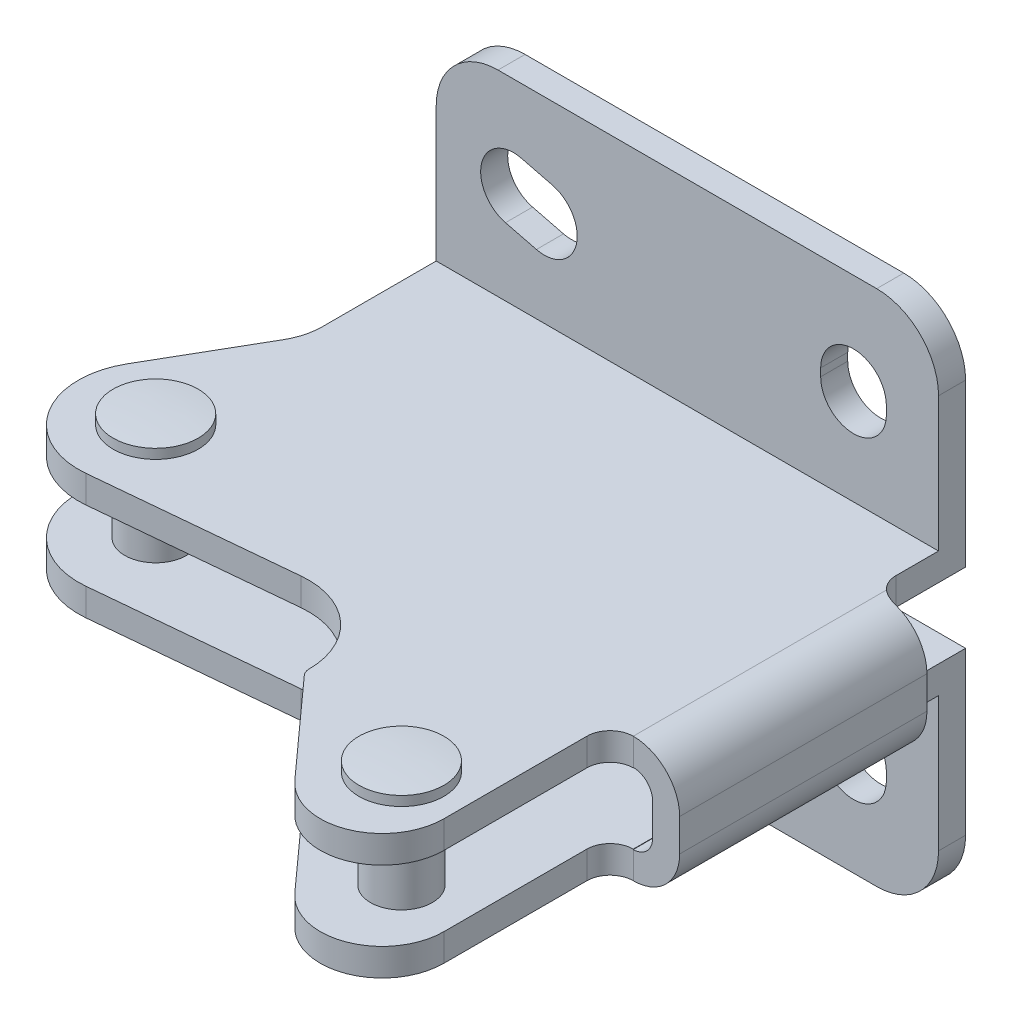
ISO-10303-21;
HEADER;
FILE_DESCRIPTION(('STEP AP214'),'2;1');
FILE_NAME('part.step','',(''),(''),'','','');
FILE_SCHEMA(('AUTOMOTIVE_DESIGN { 1 0 10303 214 1 1 1 1 }'));
ENDSEC;
DATA;
#1=APPLICATION_CONTEXT('core data for automotive mechanical design processes');
#2=APPLICATION_PROTOCOL_DEFINITION('international standard','automotive_design',2000,#1);
#3=PRODUCT_CONTEXT('',#1,'mechanical');
#4=PRODUCT('Part','Part','',(#3));
#5=PRODUCT_RELATED_PRODUCT_CATEGORY('part','',(#4));
#6=PRODUCT_DEFINITION_FORMATION('','',#4);
#7=PRODUCT_DEFINITION_CONTEXT('part definition',#1,'design');
#8=PRODUCT_DEFINITION('design','',#6,#7);
#9=PRODUCT_DEFINITION_SHAPE('','',#8);
#10=(LENGTH_UNIT() NAMED_UNIT(*) SI_UNIT(.MILLI.,.METRE.));
#11=(NAMED_UNIT(*) PLANE_ANGLE_UNIT() SI_UNIT($,.RADIAN.));
#12=(NAMED_UNIT(*) SI_UNIT($,.STERADIAN.) SOLID_ANGLE_UNIT());
#13=UNCERTAINTY_MEASURE_WITH_UNIT(LENGTH_MEASURE(1.E-05),#10,'distance_accuracy_value','');
#14=(GEOMETRIC_REPRESENTATION_CONTEXT(3) GLOBAL_UNCERTAINTY_ASSIGNED_CONTEXT((#13)) GLOBAL_UNIT_ASSIGNED_CONTEXT((#10,
#11,#12)) REPRESENTATION_CONTEXT('',''));
#15=CARTESIAN_POINT('',(0.,0.,0.));
#16=DIRECTION('',(0.,0.,1.));
#17=DIRECTION('',(1.,0.,0.));
#18=AXIS2_PLACEMENT_3D('',#15,#16,#17);
#19=CARTESIAN_POINT('',(45.,15.4877132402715,63.));
#20=DIRECTION('',(0.,1.,0.));
#21=DIRECTION('',(0.,0.,1.));
#22=AXIS2_PLACEMENT_3D('',#19,#20,#21);
#23=CYLINDRICAL_SURFACE('',#22,4.);
#24=CARTESIAN_POINT('',(45.,25.55,63.));
#25=DIRECTION('',(0.,-1.,0.));
#26=DIRECTION('',(0.,0.,1.));
#27=AXIS2_PLACEMENT_3D('',#24,#25,#26);
#28=CIRCLE('',#27,4.);
#29=CARTESIAN_POINT('',(45.,25.55,67.));
#30=VERTEX_POINT('',#29);
#31=EDGE_CURVE('E9',#30,#30,#28,.F.);
#32=ORIENTED_EDGE('',*,*,#31,.F.);
#33=EDGE_LOOP('',(#32));
#34=FACE_BOUND('',#33,.T.);
#35=CARTESIAN_POINT('',(45.,16.45,63.));
#36=DIRECTION('',(0.,1.,0.));
#37=DIRECTION('',(0.,0.,-1.));
#38=AXIS2_PLACEMENT_3D('',#35,#36,#37);
#39=CIRCLE('',#38,4.);
#40=CARTESIAN_POINT('',(45.,16.45,59.));
#41=VERTEX_POINT('',#40);
#42=EDGE_CURVE('E768',#41,#41,#39,.F.);
#43=ORIENTED_EDGE('',*,*,#42,.F.);
#44=EDGE_LOOP('',(#43));
#45=FACE_BOUND('',#44,.T.);
#46=ADVANCED_FACE('F14',(#34,#45),#23,.T.);
#47=CARTESIAN_POINT('',(45.,13.9,63.));
#48=DIRECTION('',(0.,-1.,0.));
#49=DIRECTION('',(0.,0.,-1.));
#50=AXIS2_PLACEMENT_3D('',#47,#48,#49);
#51=CONICAL_SURFACE('',#50,2.75,1.04719755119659);
#52=CARTESIAN_POINT('',(45.,15.4877132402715,63.));
#53=VERTEX_POINT('',#52);
#54=VERTEX_LOOP('',#53);
#55=FACE_BOUND('',#54,.T.);
#56=CARTESIAN_POINT('',(45.,13.9,63.));
#57=DIRECTION('',(0.,1.,0.));
#58=DIRECTION('',(0.,0.,1.));
#59=AXIS2_PLACEMENT_3D('',#56,#57,#58);
#60=CIRCLE('',#59,2.75);
#61=CARTESIAN_POINT('',(45.,13.9,65.75));
#62=VERTEX_POINT('',#61);
#63=EDGE_CURVE('E800',#62,#62,#60,.T.);
#64=ORIENTED_EDGE('',*,*,#63,.F.);
#65=EDGE_LOOP('',(#64));
#66=FACE_BOUND('',#65,.T.);
#67=ADVANCED_FACE('F911',(#55,#66),#51,.F.);
#68=CARTESIAN_POINT('',(45.,15.4877132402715,63.));
#69=DIRECTION('',(0.,1.,0.));
#70=DIRECTION('',(0.,0.,1.));
#71=AXIS2_PLACEMENT_3D('',#68,#69,#70);
#72=CYLINDRICAL_SURFACE('',#71,2.75);
#73=ORIENTED_EDGE('',*,*,#63,.T.);
#74=EDGE_LOOP('',(#73));
#75=FACE_BOUND('',#74,.T.);
#76=CARTESIAN_POINT('',(45.,11.4630539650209,63.));
#77=DIRECTION('',(0.,1.,0.));
#78=DIRECTION('',(0.,0.,1.));
#79=AXIS2_PLACEMENT_3D('',#76,#77,#78);
#80=CIRCLE('',#79,2.75000000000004);
#81=CARTESIAN_POINT('',(45.,11.4630539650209,60.2500000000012));
#82=VERTEX_POINT('',#81);
#83=EDGE_CURVE('E1035',#82,#82,#80,.T.);
#84=ORIENTED_EDGE('',*,*,#83,.F.);
#85=EDGE_LOOP('',(#84));
#86=FACE_BOUND('',#85,.T.);
#87=ADVANCED_FACE('F919',(#75,#86),#72,.F.);
#88=CARTESIAN_POINT('',(45.,71.4000000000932,63.0000000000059));
#89=DIRECTION('',(0.,1.,0.));
#90=DIRECTION('',(0.,0.,-1.));
#91=AXIS2_PLACEMENT_3D('',#88,#89,#90);
#92=SPHERICAL_SURFACE('',#91,60.0000000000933);
#93=CARTESIAN_POINT('',(45.,11.6526151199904,63.));
#94=DIRECTION('',(0.,1.,0.));
#95=DIRECTION('',(0.,0.,1.));
#96=AXIS2_PLACEMENT_3D('',#93,#94,#95);
#97=CIRCLE('',#96,5.5);
#98=CARTESIAN_POINT('',(45.,11.6526151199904,57.5000000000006));
#99=VERTEX_POINT('',#98);
#100=EDGE_CURVE('E1038',#99,#99,#97,.T.);
#101=CARTESIAN_POINT('',(45.,11.4630539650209,60.2500000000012));
#102=CARTESIAN_POINT('',(45.,11.4643701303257,60.2213138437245));
#103=CARTESIAN_POINT('',(45.,11.4657068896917,60.1926286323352));
#104=CARTESIAN_POINT('',(45.,11.4684215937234,60.1352601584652));
#105=CARTESIAN_POINT('',(45.,11.4697995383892,60.1065768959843));
#106=CARTESIAN_POINT('',(45.,11.4725966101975,60.0492123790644));
#107=CARTESIAN_POINT('',(45.,11.4740157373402,60.0205311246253));
#108=CARTESIAN_POINT('',(45.,11.476895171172,59.963170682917));
#109=CARTESIAN_POINT('',(45.,11.4783554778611,59.9344914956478));
#110=CARTESIAN_POINT('',(45.,11.4813172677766,59.8771352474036));
#111=CARTESIAN_POINT('',(45.,11.482818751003,59.8484581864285));
#112=CARTESIAN_POINT('',(45.,11.4858628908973,59.7911062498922));
#113=CARTESIAN_POINT('',(45.,11.4874055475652,59.762431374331));
#114=CARTESIAN_POINT('',(45.,11.4905320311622,59.7050838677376));
#115=CARTESIAN_POINT('',(45.,11.4921158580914,59.6764112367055));
#116=CARTESIAN_POINT('',(45.,11.4953246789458,59.6190682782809));
#117=CARTESIAN_POINT('',(45.,11.4969496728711,59.5903979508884));
#118=CARTESIAN_POINT('',(45.,11.5002408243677,59.5330596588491));
#119=CARTESIAN_POINT('',(45.,11.5019069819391,59.5043916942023));
#120=CARTESIAN_POINT('',(45.,11.5052804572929,59.4470581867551));
#121=CARTESIAN_POINT('',(45.,11.5069877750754,59.4183926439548));
#122=CARTESIAN_POINT('',(45.,11.5104435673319,59.3610640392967));
#123=CARTESIAN_POINT('',(45.,11.5121920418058,59.332400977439));
#124=CARTESIAN_POINT('',(45.,11.5157301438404,59.2750773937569));
#125=CARTESIAN_POINT('',(45.,11.5175197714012,59.2464168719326));
#126=CARTESIAN_POINT('',(45.,11.52114017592,59.1890984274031));
#127=CARTESIAN_POINT('',(45.,11.5229709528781,59.1604405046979));
#128=CARTESIAN_POINT('',(45.,11.5266736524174,59.103127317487));
#129=CARTESIAN_POINT('',(45.,11.5285455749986,59.0744720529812));
#130=CARTESIAN_POINT('',(45.,11.532330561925,59.0171642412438));
#131=CARTESIAN_POINT('',(45.,11.5342436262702,58.9885116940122));
#132=CARTESIAN_POINT('',(45.,11.5381108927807,58.9312093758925));
#133=CARTESIAN_POINT('',(45.,11.540065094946,58.9025596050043));
#134=CARTESIAN_POINT('',(45.,11.544014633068,58.8452628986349));
#135=CARTESIAN_POINT('',(45.,11.5460099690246,58.8166159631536));
#136=CARTESIAN_POINT('',(45.,11.5500417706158,58.7593249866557));
#137=CARTESIAN_POINT('',(45.,11.5520782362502,58.730680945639));
#138=CARTESIAN_POINT('',(45.,11.5561922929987,58.6733958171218));
#139=CARTESIAN_POINT('',(45.,11.5582698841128,58.6447547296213));
#140=CARTESIAN_POINT('',(45.,11.5624661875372,58.5874755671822));
#141=CARTESIAN_POINT('',(45.,11.5645848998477,58.5588374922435));
#142=CARTESIAN_POINT('',(45.,11.5688634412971,58.5015644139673));
#143=CARTESIAN_POINT('',(45.,11.5710232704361,58.4729294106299));
#144=CARTESIAN_POINT('',(45.,11.57538404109,58.4156625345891));
#145=CARTESIAN_POINT('',(45.,11.5775849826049,58.3870306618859));
#146=CARTESIAN_POINT('',(45.,11.5820279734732,58.3297701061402));
#147=CARTESIAN_POINT('',(45.,11.5842700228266,58.3011414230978));
#148=CARTESIAN_POINT('',(45.,11.5887952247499,58.2438873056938));
#149=CARTESIAN_POINT('',(45.,11.5910783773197,58.2152618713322));
#150=CARTESIAN_POINT('',(45.,11.5956857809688,58.1580143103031));
#151=CARTESIAN_POINT('',(45.,11.5980100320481,58.1293921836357));
#152=CARTESIAN_POINT('',(45.,11.6026996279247,58.0721512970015));
#153=CARTESIAN_POINT('',(45.,11.6050649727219,58.0435325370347));
#154=CARTESIAN_POINT('',(45.,11.6098367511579,57.9862984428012));
#155=CARTESIAN_POINT('',(45.,11.6122431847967,57.9576831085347));
#156=CARTESIAN_POINT('',(45.,11.6170971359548,57.9004559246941));
#157=CARTESIAN_POINT('',(45.,11.6195446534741,57.8718440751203));
#158=CARTESIAN_POINT('',(45.,11.6244807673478,57.8146239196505));
#159=CARTESIAN_POINT('',(45.,11.6269693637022,57.7860156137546));
#160=CARTESIAN_POINT('',(45.,11.6319876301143,57.7288026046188));
#161=CARTESIAN_POINT('',(45.,11.6345173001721,57.7001979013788));
#162=CARTESIAN_POINT('',(45.,11.6396177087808,57.6429921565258));
#163=CARTESIAN_POINT('',(45.,11.6421884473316,57.6143911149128));
#164=CARTESIAN_POINT('',(45.,11.6473709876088,57.5571927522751));
#165=CARTESIAN_POINT('',(45.,11.6499827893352,57.5285954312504));
#166=CARTESIAN_POINT('',(45.,11.6526151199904,57.5000000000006));
#167=B_SPLINE_CURVE_WITH_KNOTS('',3,(#101,#102,#103,#104,#105,#106,#107,#108,#109,#110,#111,
#112,#113,#114,#115,#116,#117,#118,#119,#120,#121,#122,#123,#124,#125,#126,#127,#128,#129,#130,
#131,#132,#133,#134,#135,#136,#137,#138,#139,#140,#141,#142,#143,#144,#145,#146,#147,#148,#149,
#150,#151,#152,#153,#154,#155,#156,#157,#158,#159,#160,#161,#162,#163,#164,#165,#166),
.UNSPECIFIED.,.F.,.F.,(4,2,2,2,2,2,2,2,2,2,2,2,2,2,2,2,2,2,2,2,2,2,2,2,2,2,2,2,2,2,2,2,4),(0.,
0.0861489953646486,0.172297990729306,0.258446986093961,0.344595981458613,0.430744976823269,
0.516893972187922,0.60304296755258,0.689191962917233,0.775340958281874,0.861489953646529,
0.94763894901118,1.03378794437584,1.11993693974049,1.20608593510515,1.2922349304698,
1.37838392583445,1.46453292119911,1.55068191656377,1.63683091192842,1.72297990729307,
1.80912890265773,1.89527789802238,1.98142689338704,2.06757588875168,2.15372488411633,
2.23987387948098,2.32602287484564,2.41217187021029,2.49832086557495,2.5844698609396,
2.67061885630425,2.75676785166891),.UNSPECIFIED.);
#168=EDGE_CURVE('BSEAM915',#82,#99,#167,.T.);
#169=ORIENTED_EDGE('',*,*,#83,.T.);
#170=ORIENTED_EDGE('',*,*,#100,.F.);
#171=ORIENTED_EDGE('',*,*,#168,.T.);
#172=ORIENTED_EDGE('',*,*,#168,.F.);
#173=EDGE_LOOP('',(#169,#171,#170,#172));
#174=FACE_BOUND('',#173,.T.);
#175=ADVANCED_FACE('F915',(#174),#92,.T.);
#176=CARTESIAN_POINT('',(45.,15.4877132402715,63.));
#177=DIRECTION('',(0.,1.,0.));
#178=DIRECTION('',(0.,0.,1.));
#179=AXIS2_PLACEMENT_3D('',#176,#177,#178);
#180=CYLINDRICAL_SURFACE('',#179,5.5);
#181=ORIENTED_EDGE('',*,*,#100,.T.);
#182=EDGE_LOOP('',(#181));
#183=FACE_BOUND('',#182,.T.);
#184=CARTESIAN_POINT('',(45.,12.9,63.));
#185=DIRECTION('',(0.,1.,0.));
#186=DIRECTION('',(0.,0.,1.));
#187=AXIS2_PLACEMENT_3D('',#184,#185,#186);
#188=CIRCLE('',#187,5.5);
#189=CARTESIAN_POINT('',(45.,12.9,68.5));
#190=VERTEX_POINT('',#189);
#191=EDGE_CURVE('E780',#190,#190,#188,.T.);
#192=ORIENTED_EDGE('',*,*,#191,.F.);
#193=EDGE_LOOP('',(#192));
#194=FACE_BOUND('',#193,.T.);
#195=ADVANCED_FACE('F905',(#183,#194),#180,.T.);
#196=CARTESIAN_POINT('',(45.,-29.3999999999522,62.9999999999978));
#197=DIRECTION('',(0.,1.,0.));
#198=DIRECTION('',(0.,0.,1.));
#199=AXIS2_PLACEMENT_3D('',#196,#197,#198);
#200=SPHERICAL_SURFACE('',#199,59.9999999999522);
#201=CARTESIAN_POINT('',(45.,30.3473848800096,63.));
#202=DIRECTION('',(0.,1.,0.));
#203=DIRECTION('',(0.,0.,1.));
#204=AXIS2_PLACEMENT_3D('',#201,#202,#203);
#205=CIRCLE('',#204,5.5);
#206=CARTESIAN_POINT('',(45.,30.3473848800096,68.5));
#207=VERTEX_POINT('',#206);
#208=EDGE_CURVE('E769',#207,#207,#205,.T.);
#209=ORIENTED_EDGE('',*,*,#208,.T.);
#210=EDGE_LOOP('',(#209));
#211=FACE_BOUND('',#210,.T.);
#212=ADVANCED_FACE('F902',(#211),#200,.T.);
#213=CARTESIAN_POINT('',(45.,15.4877132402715,63.));
#214=DIRECTION('',(0.,1.,0.));
#215=DIRECTION('',(0.,0.,1.));
#216=AXIS2_PLACEMENT_3D('',#213,#214,#215);
#217=CYLINDRICAL_SURFACE('',#216,5.5);
#218=CARTESIAN_POINT('',(45.,29.1,63.));
#219=DIRECTION('',(0.,1.,0.));
#220=DIRECTION('',(0.,0.,1.));
#221=AXIS2_PLACEMENT_3D('',#218,#219,#220);
#222=CIRCLE('',#221,5.5);
#223=CARTESIAN_POINT('',(45.,29.1,68.5));
#224=VERTEX_POINT('',#223);
#225=EDGE_CURVE('E775',#224,#224,#222,.T.);
#226=ORIENTED_EDGE('',*,*,#225,.T.);
#227=EDGE_LOOP('',(#226));
#228=FACE_BOUND('',#227,.T.);
#229=ORIENTED_EDGE('',*,*,#208,.F.);
#230=EDGE_LOOP('',(#229));
#231=FACE_BOUND('',#230,.T.);
#232=ADVANCED_FACE('F900',(#228,#231),#217,.T.);
#233=CARTESIAN_POINT('',(-9.8,13.9,40.));
#234=DIRECTION('',(0.,-1.,0.));
#235=DIRECTION('',(0.,0.,-1.));
#236=AXIS2_PLACEMENT_3D('',#233,#234,#235);
#237=CONICAL_SURFACE('',#236,2.75,1.04719755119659);
#238=CARTESIAN_POINT('',(-9.8,15.4877132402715,40.));
#239=VERTEX_POINT('',#238);
#240=VERTEX_LOOP('',#239);
#241=FACE_BOUND('',#240,.T.);
#242=CARTESIAN_POINT('',(-9.8,13.9,40.));
#243=DIRECTION('',(0.,1.,0.));
#244=DIRECTION('',(0.,0.,1.));
#245=AXIS2_PLACEMENT_3D('',#242,#243,#244);
#246=CIRCLE('',#245,2.75);
#247=CARTESIAN_POINT('',(-9.8,13.9,42.75));
#248=VERTEX_POINT('',#247);
#249=EDGE_CURVE('E765',#248,#248,#246,.T.);
#250=ORIENTED_EDGE('',*,*,#249,.F.);
#251=EDGE_LOOP('',(#250));
#252=FACE_BOUND('',#251,.T.);
#253=ADVANCED_FACE('F841',(#241,#252),#237,.F.);
#254=CARTESIAN_POINT('',(-9.8,15.4877132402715,40.));
#255=DIRECTION('',(0.,1.,0.));
#256=DIRECTION('',(0.,0.,1.));
#257=AXIS2_PLACEMENT_3D('',#254,#255,#256);
#258=CYLINDRICAL_SURFACE('',#257,2.75);
#259=ORIENTED_EDGE('',*,*,#249,.T.);
#260=EDGE_LOOP('',(#259));
#261=FACE_BOUND('',#260,.T.);
#262=CARTESIAN_POINT('',(-9.8,11.4630539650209,40.));
#263=DIRECTION('',(0.,1.,0.));
#264=DIRECTION('',(0.,0.,1.));
#265=AXIS2_PLACEMENT_3D('',#262,#263,#264);
#266=CIRCLE('',#265,2.75000000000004);
#267=CARTESIAN_POINT('',(-9.8,11.4630539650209,37.2500000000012));
#268=VERTEX_POINT('',#267);
#269=EDGE_CURVE('E786',#268,#268,#266,.T.);
#270=ORIENTED_EDGE('',*,*,#269,.F.);
#271=EDGE_LOOP('',(#270));
#272=FACE_BOUND('',#271,.T.);
#273=ADVANCED_FACE('F824',(#261,#272),#258,.F.);
#274=CARTESIAN_POINT('',(-9.8,-29.3999999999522,39.9999999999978));
#275=DIRECTION('',(0.,1.,0.));
#276=DIRECTION('',(0.,0.,1.));
#277=AXIS2_PLACEMENT_3D('',#274,#275,#276);
#278=SPHERICAL_SURFACE('',#277,59.9999999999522);
#279=CARTESIAN_POINT('',(-9.8,30.3473848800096,40.));
#280=DIRECTION('',(0.,1.,0.));
#281=DIRECTION('',(0.,0.,1.));
#282=AXIS2_PLACEMENT_3D('',#279,#280,#281);
#283=CIRCLE('',#282,5.5);
#284=CARTESIAN_POINT('',(-9.8,30.3473848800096,45.5));
#285=VERTEX_POINT('',#284);
#286=EDGE_CURVE('E798',#285,#285,#283,.T.);
#287=ORIENTED_EDGE('',*,*,#286,.T.);
#288=EDGE_LOOP('',(#287));
#289=FACE_BOUND('',#288,.T.);
#290=ADVANCED_FACE('F846',(#289),#278,.T.);
#291=CARTESIAN_POINT('',(5.030776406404,45.123105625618,3.5));
#292=DIRECTION('',(-0.242535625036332,-0.970142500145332,0.));
#293=DIRECTION('',(0.970142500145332,-0.242535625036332,0.));
#294=AXIS2_PLACEMENT_3D('',#291,#292,#293);
#295=PLANE('',#294);
#296=DIRECTION('',(-0.970142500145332,0.242535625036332,0.));
#297=VECTOR('',#296,1.);
#298=CARTESIAN_POINT('',(5.030776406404,45.123105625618,0.));
#299=LINE('',#298,#297);
#300=CARTESIAN_POINT('',(5.030776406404,45.123105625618,0.));
#301=VERTEX_POINT('',#300);
#302=CARTESIAN_POINT('',(1.030776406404,46.123105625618,0.));
#303=VERTEX_POINT('',#302);
#304=EDGE_CURVE('E341',#301,#303,#299,.T.);
#305=ORIENTED_EDGE('',*,*,#304,.F.);
#306=DIRECTION('',(0.,0.,-1.));
#307=VECTOR('',#306,1.);
#308=CARTESIAN_POINT('',(5.030776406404,45.123105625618,3.5));
#309=LINE('',#308,#307);
#310=CARTESIAN_POINT('',(5.030776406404,45.123105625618,3.5));
#311=VERTEX_POINT('',#310);
#312=EDGE_CURVE('E359',#311,#301,#309,.T.);
#313=ORIENTED_EDGE('',*,*,#312,.F.);
#314=DIRECTION('',(-0.970142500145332,0.242535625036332,0.));
#315=VECTOR('',#314,1.);
#316=CARTESIAN_POINT('',(5.030776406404,45.123105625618,3.5));
#317=LINE('',#316,#315);
#318=CARTESIAN_POINT('',(1.030776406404,46.123105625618,3.5));
#319=VERTEX_POINT('',#318);
#320=EDGE_CURVE('E355',#311,#319,#317,.T.);
#321=ORIENTED_EDGE('',*,*,#320,.T.);
#322=DIRECTION('',(0.,0.,-1.));
#323=VECTOR('',#322,1.);
#324=CARTESIAN_POINT('',(1.030776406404,46.123105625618,3.5));
#325=LINE('',#324,#323);
#326=EDGE_CURVE('E312',#319,#303,#325,.T.);
#327=ORIENTED_EDGE('',*,*,#326,.T.);
#328=EDGE_LOOP('',(#305,#313,#321,#327));
#329=FACE_BOUND('',#328,.T.);
#330=ADVANCED_FACE('F809',(#329),#295,.T.);
#331=CARTESIAN_POINT('',(4.,41.,3.5));
#332=DIRECTION('',(0.,0.,-1.));
#333=DIRECTION('',(0.,-1.,0.));
#334=AXIS2_PLACEMENT_3D('',#331,#332,#333);
#335=CYLINDRICAL_SURFACE('',#334,4.25000000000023);
#336=CARTESIAN_POINT('',(4.,41.,0.));
#337=DIRECTION('',(0.,0.,1.));
#338=DIRECTION('',(-1.,0.,0.));
#339=AXIS2_PLACEMENT_3D('',#336,#337,#338);
#340=CIRCLE('',#339,4.25000000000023);
#341=CARTESIAN_POINT('',(2.969223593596,36.876894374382,0.));
#342=VERTEX_POINT('',#341);
#343=EDGE_CURVE('E330',#342,#301,#340,.T.);
#344=ORIENTED_EDGE('',*,*,#343,.F.);
#345=DIRECTION('',(0.,0.,-1.));
#346=VECTOR('',#345,1.);
#347=CARTESIAN_POINT('',(2.969223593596,36.876894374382,3.5));
#348=LINE('',#347,#346);
#349=CARTESIAN_POINT('',(2.969223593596,36.876894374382,3.5));
#350=VERTEX_POINT('',#349);
#351=EDGE_CURVE('E325',#350,#342,#348,.T.);
#352=ORIENTED_EDGE('',*,*,#351,.F.);
#353=CARTESIAN_POINT('',(4.,41.,3.5));
#354=DIRECTION('',(0.,0.,1.));
#355=DIRECTION('',(-1.,0.,0.));
#356=AXIS2_PLACEMENT_3D('',#353,#354,#355);
#357=CIRCLE('',#356,4.25000000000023);
#358=EDGE_CURVE('E349',#350,#311,#357,.T.);
#359=ORIENTED_EDGE('',*,*,#358,.T.);
#360=ORIENTED_EDGE('',*,*,#312,.T.);
#361=EDGE_LOOP('',(#344,#352,#359,#360));
#362=FACE_BOUND('',#361,.T.);
#363=ADVANCED_FACE('F804',(#362),#335,.F.);
#364=CARTESIAN_POINT('',(-1.030776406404,37.876894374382,3.5));
#365=DIRECTION('',(0.242535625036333,0.970142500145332,0.));
#366=DIRECTION('',(-0.970142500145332,0.242535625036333,0.));
#367=AXIS2_PLACEMENT_3D('',#364,#365,#366);
#368=PLANE('',#367);
#369=DIRECTION('',(0.970142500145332,-0.242535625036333,0.));
#370=VECTOR('',#369,1.);
#371=CARTESIAN_POINT('',(-1.030776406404,37.876894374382,0.));
#372=LINE('',#371,#370);
#373=CARTESIAN_POINT('',(-1.030776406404,37.876894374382,0.));
#374=VERTEX_POINT('',#373);
#375=EDGE_CURVE('E319',#374,#342,#372,.T.);
#376=ORIENTED_EDGE('',*,*,#375,.F.);
#377=DIRECTION('',(0.,0.,-1.));
#378=VECTOR('',#377,1.);
#379=CARTESIAN_POINT('',(-1.030776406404,37.876894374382,3.5));
#380=LINE('',#379,#378);
#381=CARTESIAN_POINT('',(-1.030776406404,37.876894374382,3.5));
#382=VERTEX_POINT('',#381);
#383=EDGE_CURVE('E322',#382,#374,#380,.T.);
#384=ORIENTED_EDGE('',*,*,#383,.F.);
#385=DIRECTION('',(0.970142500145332,-0.242535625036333,0.));
#386=VECTOR('',#385,1.);
#387=CARTESIAN_POINT('',(-1.030776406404,37.876894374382,3.5));
#388=LINE('',#387,#386);
#389=EDGE_CURVE('E343',#382,#350,#388,.T.);
#390=ORIENTED_EDGE('',*,*,#389,.T.);
#391=ORIENTED_EDGE('',*,*,#351,.T.);
#392=EDGE_LOOP('',(#376,#384,#390,#391));
#393=FACE_BOUND('',#392,.T.);
#394=ADVANCED_FACE('F321',(#393),#368,.T.);
#395=CARTESIAN_POINT('',(0.,42.,3.5));
#396=DIRECTION('',(0.,0.,-1.));
#397=DIRECTION('',(0.,-1.,0.));
#398=AXIS2_PLACEMENT_3D('',#395,#396,#397);
#399=CYLINDRICAL_SURFACE('',#398,4.25000000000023);
#400=CARTESIAN_POINT('',(0.,42.,0.));
#401=DIRECTION('',(0.,0.,1.));
#402=DIRECTION('',(1.,0.,0.));
#403=AXIS2_PLACEMENT_3D('',#400,#401,#402);
#404=CIRCLE('',#403,4.25000000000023);
#405=EDGE_CURVE('E334',#303,#374,#404,.T.);
#406=ORIENTED_EDGE('',*,*,#405,.F.);
#407=ORIENTED_EDGE('',*,*,#326,.F.);
#408=CARTESIAN_POINT('',(0.,42.,3.5));
#409=DIRECTION('',(0.,0.,1.));
#410=DIRECTION('',(1.,0.,0.));
#411=AXIS2_PLACEMENT_3D('',#408,#409,#410);
#412=CIRCLE('',#411,4.25000000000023);
#413=EDGE_CURVE('E337',#319,#382,#412,.T.);
#414=ORIENTED_EDGE('',*,*,#413,.T.);
#415=ORIENTED_EDGE('',*,*,#383,.T.);
#416=EDGE_LOOP('',(#406,#407,#414,#415));
#417=FACE_BOUND('',#416,.T.);
#418=ADVANCED_FACE('F333',(#417),#399,.F.);
#419=CARTESIAN_POINT('',(46.9999999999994,46.4999999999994,3.5));
#420=DIRECTION('',(0.,0.,-1.));
#421=DIRECTION('',(0.,-1.,0.));
#422=AXIS2_PLACEMENT_3D('',#419,#420,#421);
#423=CYLINDRICAL_SURFACE('',#422,8.00000000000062);
#424=CARTESIAN_POINT('',(46.9999999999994,46.4999999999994,0.));
#425=DIRECTION('',(0.,0.,1.));
#426=DIRECTION('',(-1.,0.,0.));
#427=AXIS2_PLACEMENT_3D('',#424,#425,#426);
#428=CIRCLE('',#427,8.00000000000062);
#429=CARTESIAN_POINT('',(55.,46.5,0.));
#430=VERTEX_POINT('',#429);
#431=CARTESIAN_POINT('',(47.,54.5,0.));
#432=VERTEX_POINT('',#431);
#433=EDGE_CURVE('E539',#430,#432,#428,.T.);
#434=ORIENTED_EDGE('',*,*,#433,.T.);
#435=DIRECTION('',(0.,0.,-1.));
#436=VECTOR('',#435,1.);
#437=CARTESIAN_POINT('',(47.,54.5,3.5));
#438=LINE('',#437,#436);
#439=CARTESIAN_POINT('',(47.,54.5,3.5));
#440=VERTEX_POINT('',#439);
#441=EDGE_CURVE('E596',#440,#432,#438,.T.);
#442=ORIENTED_EDGE('',*,*,#441,.F.);
#443=CARTESIAN_POINT('',(46.9999999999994,46.4999999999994,3.5));
#444=DIRECTION('',(0.,0.,1.));
#445=DIRECTION('',(-1.,0.,0.));
#446=AXIS2_PLACEMENT_3D('',#443,#444,#445);
#447=CIRCLE('',#446,8.00000000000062);
#448=CARTESIAN_POINT('',(55.,46.5,3.5));
#449=VERTEX_POINT('',#448);
#450=EDGE_CURVE('E560',#449,#440,#447,.T.);
#451=ORIENTED_EDGE('',*,*,#450,.F.);
#452=DIRECTION('',(0.,0.,-1.));
#453=VECTOR('',#452,1.);
#454=CARTESIAN_POINT('',(55.,46.5,3.5));
#455=LINE('',#454,#453);
#456=EDGE_CURVE('E599',#449,#430,#455,.T.);
#457=ORIENTED_EDGE('',*,*,#456,.T.);
#458=EDGE_LOOP('',(#434,#442,#451,#457));
#459=FACE_BOUND('',#458,.T.);
#460=ADVANCED_FACE('F1341',(#459),#423,.T.);
#461=CARTESIAN_POINT('',(47.,54.5,3.5));
#462=DIRECTION('',(0.,-1.,0.));
#463=DIRECTION('',(1.,0.,0.));
#464=AXIS2_PLACEMENT_3D('',#461,#462,#463);
#465=PLANE('',#464);
#466=DIRECTION('',(-1.,0.,0.));
#467=VECTOR('',#466,1.);
#468=CARTESIAN_POINT('',(47.,54.5,0.));
#469=LINE('',#468,#467);
#470=CARTESIAN_POINT('',(-2.,54.5,0.));
#471=VERTEX_POINT('',#470);
#472=EDGE_CURVE('E542',#432,#471,#469,.T.);
#473=ORIENTED_EDGE('',*,*,#472,.T.);
#474=DIRECTION('',(0.,0.,-1.));
#475=VECTOR('',#474,1.);
#476=CARTESIAN_POINT('',(-2.,54.5,3.5));
#477=LINE('',#476,#475);
#478=CARTESIAN_POINT('',(-2.,54.5,3.5));
#479=VERTEX_POINT('',#478);
#480=EDGE_CURVE('E593',#479,#471,#477,.T.);
#481=ORIENTED_EDGE('',*,*,#480,.F.);
#482=DIRECTION('',(-1.,0.,0.));
#483=VECTOR('',#482,1.);
#484=CARTESIAN_POINT('',(47.,54.5,3.5));
#485=LINE('',#484,#483);
#486=EDGE_CURVE('E562',#440,#479,#485,.T.);
#487=ORIENTED_EDGE('',*,*,#486,.F.);
#488=ORIENTED_EDGE('',*,*,#441,.T.);
#489=EDGE_LOOP('',(#473,#481,#487,#488));
#490=FACE_BOUND('',#489,.T.);
#491=ADVANCED_FACE('F1327',(#490),#465,.F.);
#492=CARTESIAN_POINT('',(39.75,42.,3.5));
#493=DIRECTION('',(1.,0.,0.));
#494=DIRECTION('',(0.,1.,0.));
#495=AXIS2_PLACEMENT_3D('',#492,#493,#494);
#496=PLANE('',#495);
#497=DIRECTION('',(0.,-1.,0.));
#498=VECTOR('',#497,1.);
#499=CARTESIAN_POINT('',(39.75,42.,0.));
#500=LINE('',#499,#498);
#501=CARTESIAN_POINT('',(39.75,42.,0.));
#502=VERTEX_POINT('',#501);
#503=CARTESIAN_POINT('',(39.75,41.,0.));
#504=VERTEX_POINT('',#503);
#505=EDGE_CURVE('E401',#502,#504,#500,.T.);
#506=ORIENTED_EDGE('',*,*,#505,.F.);
#507=DIRECTION('',(0.,0.,-1.));
#508=VECTOR('',#507,1.);
#509=CARTESIAN_POINT('',(39.75,42.,3.5));
#510=LINE('',#509,#508);
#511=CARTESIAN_POINT('',(39.75,42.,3.5));
#512=VERTEX_POINT('',#511);
#513=EDGE_CURVE('E426',#512,#502,#510,.T.);
#514=ORIENTED_EDGE('',*,*,#513,.F.);
#515=DIRECTION('',(0.,-1.,0.));
#516=VECTOR('',#515,1.);
#517=CARTESIAN_POINT('',(39.75,42.,3.5));
#518=LINE('',#517,#516);
#519=CARTESIAN_POINT('',(39.75,41.,3.5));
#520=VERTEX_POINT('',#519);
#521=EDGE_CURVE('E415',#512,#520,#518,.T.);
#522=ORIENTED_EDGE('',*,*,#521,.T.);
#523=DIRECTION('',(0.,0.,-1.));
#524=VECTOR('',#523,1.);
#525=CARTESIAN_POINT('',(39.75,41.,3.5));
#526=LINE('',#525,#524);
#527=EDGE_CURVE('E424',#520,#504,#526,.T.);
#528=ORIENTED_EDGE('',*,*,#527,.T.);
#529=EDGE_LOOP('',(#506,#514,#522,#528));
#530=FACE_BOUND('',#529,.T.);
#531=ADVANCED_FACE('F1338',(#530),#496,.T.);
#532=CARTESIAN_POINT('',(44.,42.,3.5));
#533=DIRECTION('',(0.,0.,-1.));
#534=DIRECTION('',(0.,-1.,0.));
#535=AXIS2_PLACEMENT_3D('',#532,#533,#534);
#536=CYLINDRICAL_SURFACE('',#535,4.25);
#537=CARTESIAN_POINT('',(44.,42.,0.));
#538=DIRECTION('',(0.,0.,1.));
#539=DIRECTION('',(1.,0.,0.));
#540=AXIS2_PLACEMENT_3D('',#537,#538,#539);
#541=CIRCLE('',#540,4.25);
#542=CARTESIAN_POINT('',(48.25,42.,0.));
#543=VERTEX_POINT('',#542);
#544=EDGE_CURVE('E397',#543,#502,#541,.T.);
#545=ORIENTED_EDGE('',*,*,#544,.F.);
#546=DIRECTION('',(0.,0.,-1.));
#547=VECTOR('',#546,1.);
#548=CARTESIAN_POINT('',(48.25,42.,3.5));
#549=LINE('',#548,#547);
#550=CARTESIAN_POINT('',(48.25,42.,3.5));
#551=VERTEX_POINT('',#550);
#552=EDGE_CURVE('E428',#551,#543,#549,.T.);
#553=ORIENTED_EDGE('',*,*,#552,.F.);
#554=CARTESIAN_POINT('',(44.,42.,3.5));
#555=DIRECTION('',(0.,0.,1.));
#556=DIRECTION('',(1.,0.,0.));
#557=AXIS2_PLACEMENT_3D('',#554,#555,#556);
#558=CIRCLE('',#557,4.25);
#559=EDGE_CURVE('E413',#551,#512,#558,.T.);
#560=ORIENTED_EDGE('',*,*,#559,.T.);
#561=ORIENTED_EDGE('',*,*,#513,.T.);
#562=EDGE_LOOP('',(#545,#553,#560,#561));
#563=FACE_BOUND('',#562,.T.);
#564=ADVANCED_FACE('F1348',(#563),#536,.F.);
#565=CARTESIAN_POINT('',(48.25,41.,3.5));
#566=DIRECTION('',(-1.,0.,0.));
#567=DIRECTION('',(0.,-1.,0.));
#568=AXIS2_PLACEMENT_3D('',#565,#566,#567);
#569=PLANE('',#568);
#570=DIRECTION('',(0.,1.,0.));
#571=VECTOR('',#570,1.);
#572=CARTESIAN_POINT('',(48.25,41.,0.));
#573=LINE('',#572,#571);
#574=CARTESIAN_POINT('',(48.25,41.,0.));
#575=VERTEX_POINT('',#574);
#576=EDGE_CURVE('E396',#575,#543,#573,.T.);
#577=ORIENTED_EDGE('',*,*,#576,.F.);
#578=DIRECTION('',(0.,0.,-1.));
#579=VECTOR('',#578,1.);
#580=CARTESIAN_POINT('',(48.25,41.,3.5));
#581=LINE('',#580,#579);
#582=CARTESIAN_POINT('',(48.25,41.,3.5));
#583=VERTEX_POINT('',#582);
#584=EDGE_CURVE('E420',#583,#575,#581,.T.);
#585=ORIENTED_EDGE('',*,*,#584,.F.);
#586=DIRECTION('',(0.,1.,0.));
#587=VECTOR('',#586,1.);
#588=CARTESIAN_POINT('',(48.25,41.,3.5));
#589=LINE('',#588,#587);
#590=EDGE_CURVE('E409',#583,#551,#589,.T.);
#591=ORIENTED_EDGE('',*,*,#590,.T.);
#592=ORIENTED_EDGE('',*,*,#552,.T.);
#593=EDGE_LOOP('',(#577,#585,#591,#592));
#594=FACE_BOUND('',#593,.T.);
#595=ADVANCED_FACE('F1334',(#594),#569,.T.);
#596=CARTESIAN_POINT('',(44.,41.,3.5));
#597=DIRECTION('',(0.,0.,-1.));
#598=DIRECTION('',(0.,-1.,0.));
#599=AXIS2_PLACEMENT_3D('',#596,#597,#598);
#600=CYLINDRICAL_SURFACE('',#599,4.25);
#601=CARTESIAN_POINT('',(44.,41.,0.));
#602=DIRECTION('',(0.,0.,1.));
#603=DIRECTION('',(-1.,0.,0.));
#604=AXIS2_PLACEMENT_3D('',#601,#602,#603);
#605=CIRCLE('',#604,4.25);
#606=EDGE_CURVE('E405',#504,#575,#605,.T.);
#607=ORIENTED_EDGE('',*,*,#606,.F.);
#608=ORIENTED_EDGE('',*,*,#527,.F.);
#609=CARTESIAN_POINT('',(44.,41.,3.5));
#610=DIRECTION('',(0.,0.,1.));
#611=DIRECTION('',(-1.,0.,0.));
#612=AXIS2_PLACEMENT_3D('',#609,#610,#611);
#613=CIRCLE('',#612,4.25);
#614=EDGE_CURVE('E418',#520,#583,#613,.T.);
#615=ORIENTED_EDGE('',*,*,#614,.T.);
#616=ORIENTED_EDGE('',*,*,#584,.T.);
#617=EDGE_LOOP('',(#607,#608,#615,#616));
#618=FACE_BOUND('',#617,.T.);
#619=ADVANCED_FACE('F1325',(#618),#600,.F.);
#620=CARTESIAN_POINT('',(-1.9999999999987,46.4999999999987,3.5));
#621=DIRECTION('',(0.,0.,-1.));
#622=DIRECTION('',(0.,-1.,0.));
#623=AXIS2_PLACEMENT_3D('',#620,#621,#622);
#624=CYLINDRICAL_SURFACE('',#623,8.00000000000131);
#625=CARTESIAN_POINT('',(-1.9999999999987,46.4999999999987,0.));
#626=DIRECTION('',(0.,0.,1.));
#627=DIRECTION('',(1.,0.,0.));
#628=AXIS2_PLACEMENT_3D('',#625,#626,#627);
#629=CIRCLE('',#628,8.00000000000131);
#630=CARTESIAN_POINT('',(-10.,46.4999999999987,0.));
#631=VERTEX_POINT('',#630);
#632=EDGE_CURVE('E545',#471,#631,#629,.T.);
#633=ORIENTED_EDGE('',*,*,#632,.T.);
#634=DIRECTION('',(0.,0.,-1.));
#635=VECTOR('',#634,1.);
#636=CARTESIAN_POINT('',(-10.,46.4999999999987,3.5));
#637=LINE('',#636,#635);
#638=CARTESIAN_POINT('',(-10.,46.4999999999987,3.5));
#639=VERTEX_POINT('',#638);
#640=EDGE_CURVE('E590',#639,#631,#637,.T.);
#641=ORIENTED_EDGE('',*,*,#640,.F.);
#642=CARTESIAN_POINT('',(-1.9999999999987,46.4999999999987,3.5));
#643=DIRECTION('',(0.,0.,1.));
#644=DIRECTION('',(1.,0.,0.));
#645=AXIS2_PLACEMENT_3D('',#642,#643,#644);
#646=CIRCLE('',#645,8.00000000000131);
#647=EDGE_CURVE('E565',#479,#639,#646,.T.);
#648=ORIENTED_EDGE('',*,*,#647,.F.);
#649=ORIENTED_EDGE('',*,*,#480,.T.);
#650=EDGE_LOOP('',(#633,#641,#648,#649));
#651=FACE_BOUND('',#650,.T.);
#652=ADVANCED_FACE('F1313',(#651),#624,.T.);
#653=CARTESIAN_POINT('',(58.5,18.9,73.5));
#654=DIRECTION('',(-1.,0.,0.));
#655=DIRECTION('',(0.,-1.,0.));
#656=AXIS2_PLACEMENT_3D('',#653,#654,#655);
#657=PLANE('',#656);
#658=DIRECTION('',(0.,0.,-1.));
#659=VECTOR('',#658,1.);
#660=CARTESIAN_POINT('',(58.5,18.9,73.5));
#661=LINE('',#660,#659);
#662=CARTESIAN_POINT('',(58.5,18.9,44.));
#663=VERTEX_POINT('',#662);
#664=CARTESIAN_POINT('',(58.5,18.9,12.));
#665=VERTEX_POINT('',#664);
#666=EDGE_CURVE('E1208',#663,#665,#661,.T.);
#667=ORIENTED_EDGE('',*,*,#666,.F.);
#668=DIRECTION('',(0.,-1.,0.));
#669=VECTOR('',#668,1.);
#670=CARTESIAN_POINT('',(58.5,12.9,44.));
#671=LINE('',#670,#669);
#672=CARTESIAN_POINT('',(58.5,23.1,44.));
#673=VERTEX_POINT('',#672);
#674=EDGE_CURVE('E760',#673,#663,#671,.T.);
#675=ORIENTED_EDGE('',*,*,#674,.F.);
#676=DIRECTION('',(0.,0.,-1.));
#677=VECTOR('',#676,1.);
#678=CARTESIAN_POINT('',(58.5,23.1,73.5));
#679=LINE('',#678,#677);
#680=CARTESIAN_POINT('',(58.5,23.1,12.));
#681=VERTEX_POINT('',#680);
#682=EDGE_CURVE('E522',#673,#681,#679,.T.);
#683=ORIENTED_EDGE('',*,*,#682,.T.);
#684=DIRECTION('',(0.,1.,0.));
#685=VECTOR('',#684,1.);
#686=CARTESIAN_POINT('',(58.5,12.9,12.));
#687=LINE('',#686,#685);
#688=EDGE_CURVE('E536',#665,#681,#687,.T.);
#689=ORIENTED_EDGE('',*,*,#688,.F.);
#690=EDGE_LOOP('',(#667,#675,#683,#689));
#691=FACE_BOUND('',#690,.T.);
#692=ADVANCED_FACE('F857',(#691),#657,.T.);
#693=CARTESIAN_POINT('',(2.969223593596,5.123105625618,3.5));
#694=DIRECTION('',(0.242535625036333,-0.970142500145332,0.));
#695=DIRECTION('',(0.970142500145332,0.242535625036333,0.));
#696=AXIS2_PLACEMENT_3D('',#693,#694,#695);
#697=PLANE('',#696);
#698=DIRECTION('',(-0.970142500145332,-0.242535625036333,0.));
#699=VECTOR('',#698,1.);
#700=CARTESIAN_POINT('',(2.969223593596,5.123105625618,0.));
#701=LINE('',#700,#699);
#702=CARTESIAN_POINT('',(2.969223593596,5.123105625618,0.));
#703=VERTEX_POINT('',#702);
#704=CARTESIAN_POINT('',(-1.030776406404,4.123105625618,0.));
#705=VERTEX_POINT('',#704);
#706=EDGE_CURVE('E367',#703,#705,#701,.T.);
#707=ORIENTED_EDGE('',*,*,#706,.F.);
#708=DIRECTION('',(0.,0.,-1.));
#709=VECTOR('',#708,1.);
#710=CARTESIAN_POINT('',(2.969223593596,5.123105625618,3.5));
#711=LINE('',#710,#709);
#712=CARTESIAN_POINT('',(2.969223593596,5.123105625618,3.5));
#713=VERTEX_POINT('',#712);
#714=EDGE_CURVE('E391',#713,#703,#711,.T.);
#715=ORIENTED_EDGE('',*,*,#714,.F.);
#716=DIRECTION('',(-0.970142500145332,-0.242535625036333,0.));
#717=VECTOR('',#716,1.);
#718=CARTESIAN_POINT('',(2.969223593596,5.123105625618,3.5));
#719=LINE('',#718,#717);
#720=CARTESIAN_POINT('',(-1.030776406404,4.123105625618,3.5));
#721=VERTEX_POINT('',#720);
#722=EDGE_CURVE('E380',#713,#721,#719,.T.);
#723=ORIENTED_EDGE('',*,*,#722,.T.);
#724=DIRECTION('',(0.,0.,-1.));
#725=VECTOR('',#724,1.);
#726=CARTESIAN_POINT('',(-1.030776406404,4.123105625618,3.5));
#727=LINE('',#726,#725);
#728=EDGE_CURVE('E389',#721,#705,#727,.T.);
#729=ORIENTED_EDGE('',*,*,#728,.T.);
#730=EDGE_LOOP('',(#707,#715,#723,#729));
#731=FACE_BOUND('',#730,.T.);
#732=ADVANCED_FACE('F1333',(#731),#697,.T.);
#733=CARTESIAN_POINT('',(0.,0.,3.5));
#734=DIRECTION('',(0.,0.,-1.));
#735=DIRECTION('',(0.,-1.,0.));
#736=AXIS2_PLACEMENT_3D('',#733,#734,#735);
#737=CYLINDRICAL_SURFACE('',#736,4.25000000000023);
#738=CARTESIAN_POINT('',(0.,0.,0.));
#739=DIRECTION('',(0.,0.,1.));
#740=DIRECTION('',(1.,0.,0.));
#741=AXIS2_PLACEMENT_3D('',#738,#739,#740);
#742=CIRCLE('',#741,4.25000000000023);
#743=CARTESIAN_POINT('',(1.030776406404,-4.123105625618,0.));
#744=VERTEX_POINT('',#743);
#745=EDGE_CURVE('E371',#705,#744,#742,.T.);
#746=ORIENTED_EDGE('',*,*,#745,.F.);
#747=ORIENTED_EDGE('',*,*,#728,.F.);
#748=CARTESIAN_POINT('',(0.,0.,3.5));
#749=DIRECTION('',(0.,0.,1.));
#750=DIRECTION('',(1.,0.,0.));
#751=AXIS2_PLACEMENT_3D('',#748,#749,#750);
#752=CIRCLE('',#751,4.25000000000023);
#753=CARTESIAN_POINT('',(1.030776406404,-4.123105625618,3.5));
#754=VERTEX_POINT('',#753);
#755=EDGE_CURVE('E383',#721,#754,#752,.T.);
#756=ORIENTED_EDGE('',*,*,#755,.T.);
#757=DIRECTION('',(0.,0.,-1.));
#758=VECTOR('',#757,1.);
#759=CARTESIAN_POINT('',(1.030776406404,-4.123105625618,3.5));
#760=LINE('',#759,#758);
#761=EDGE_CURVE('E385',#754,#744,#760,.T.);
#762=ORIENTED_EDGE('',*,*,#761,.T.);
#763=EDGE_LOOP('',(#746,#747,#756,#762));
#764=FACE_BOUND('',#763,.T.);
#765=ADVANCED_FACE('F1887',(#764),#737,.F.);
#766=CARTESIAN_POINT('',(1.030776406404,-4.123105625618,3.5));
#767=DIRECTION('',(-0.242535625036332,0.970142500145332,0.));
#768=DIRECTION('',(-0.970142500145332,-0.242535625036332,0.));
#769=AXIS2_PLACEMENT_3D('',#766,#767,#768);
#770=PLANE('',#769);
#771=DIRECTION('',(0.970142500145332,0.242535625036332,0.));
#772=VECTOR('',#771,1.);
#773=CARTESIAN_POINT('',(1.030776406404,-4.123105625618,0.));
#774=LINE('',#773,#772);
#775=CARTESIAN_POINT('',(5.030776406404,-3.123105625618,0.));
#776=VERTEX_POINT('',#775);
#777=EDGE_CURVE('E362',#744,#776,#774,.T.);
#778=ORIENTED_EDGE('',*,*,#777,.F.);
#779=ORIENTED_EDGE('',*,*,#761,.F.);
#780=DIRECTION('',(0.970142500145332,0.242535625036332,0.));
#781=VECTOR('',#780,1.);
#782=CARTESIAN_POINT('',(1.030776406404,-4.123105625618,3.5));
#783=LINE('',#782,#781);
#784=CARTESIAN_POINT('',(5.030776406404,-3.123105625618,3.5));
#785=VERTEX_POINT('',#784);
#786=EDGE_CURVE('E375',#754,#785,#783,.T.);
#787=ORIENTED_EDGE('',*,*,#786,.T.);
#788=DIRECTION('',(0.,0.,-1.));
#789=VECTOR('',#788,1.);
#790=CARTESIAN_POINT('',(5.030776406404,-3.123105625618,3.5));
#791=LINE('',#790,#789);
#792=EDGE_CURVE('E393',#785,#776,#791,.T.);
#793=ORIENTED_EDGE('',*,*,#792,.T.);
#794=EDGE_LOOP('',(#778,#779,#787,#793));
#795=FACE_BOUND('',#794,.T.);
#796=ADVANCED_FACE('F1337',(#795),#770,.T.);
#797=CARTESIAN_POINT('',(4.,1.,3.5));
#798=DIRECTION('',(0.,0.,-1.));
#799=DIRECTION('',(0.,-1.,0.));
#800=AXIS2_PLACEMENT_3D('',#797,#798,#799);
#801=CYLINDRICAL_SURFACE('',#800,4.25000000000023);
#802=CARTESIAN_POINT('',(4.,1.,0.));
#803=DIRECTION('',(0.,0.,1.));
#804=DIRECTION('',(-1.,0.,0.));
#805=AXIS2_PLACEMENT_3D('',#802,#803,#804);
#806=CIRCLE('',#805,4.25000000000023);
#807=EDGE_CURVE('E363',#776,#703,#806,.T.);
#808=ORIENTED_EDGE('',*,*,#807,.F.);
#809=ORIENTED_EDGE('',*,*,#792,.F.);
#810=CARTESIAN_POINT('',(4.,1.,3.5));
#811=DIRECTION('',(0.,0.,1.));
#812=DIRECTION('',(-1.,0.,0.));
#813=AXIS2_PLACEMENT_3D('',#810,#811,#812);
#814=CIRCLE('',#813,4.25000000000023);
#815=EDGE_CURVE('E378',#785,#713,#814,.T.);
#816=ORIENTED_EDGE('',*,*,#815,.T.);
#817=ORIENTED_EDGE('',*,*,#714,.T.);
#818=EDGE_LOOP('',(#808,#809,#816,#817));
#819=FACE_BOUND('',#818,.T.);
#820=ADVANCED_FACE('F1310',(#819),#801,.F.);
#821=CARTESIAN_POINT('',(46.9999999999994,-4.4999999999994,3.5));
#822=DIRECTION('',(0.,0.,-1.));
#823=DIRECTION('',(0.,-1.,0.));
#824=AXIS2_PLACEMENT_3D('',#821,#822,#823);
#825=CYLINDRICAL_SURFACE('',#824,8.00000000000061);
#826=CARTESIAN_POINT('',(46.9999999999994,-4.4999999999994,0.));
#827=DIRECTION('',(0.,0.,1.));
#828=DIRECTION('',(-1.,0.,0.));
#829=AXIS2_PLACEMENT_3D('',#826,#827,#828);
#830=CIRCLE('',#829,8.00000000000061);
#831=CARTESIAN_POINT('',(47.,-12.5,0.));
#832=VERTEX_POINT('',#831);
#833=CARTESIAN_POINT('',(55.,-4.5,0.));
#834=VERTEX_POINT('',#833);
#835=EDGE_CURVE('E555',#832,#834,#830,.T.);
#836=ORIENTED_EDGE('',*,*,#835,.T.);
#837=DIRECTION('',(0.,0.,-1.));
#838=VECTOR('',#837,1.);
#839=CARTESIAN_POINT('',(55.,-4.5,3.5));
#840=LINE('',#839,#838);
#841=CARTESIAN_POINT('',(55.,-4.5,3.5));
#842=VERTEX_POINT('',#841);
#843=EDGE_CURVE('E577',#842,#834,#840,.T.);
#844=ORIENTED_EDGE('',*,*,#843,.F.);
#845=CARTESIAN_POINT('',(46.9999999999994,-4.4999999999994,3.5));
#846=DIRECTION('',(0.,0.,1.));
#847=DIRECTION('',(-1.,0.,0.));
#848=AXIS2_PLACEMENT_3D('',#845,#846,#847);
#849=CIRCLE('',#848,8.00000000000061);
#850=CARTESIAN_POINT('',(47.,-12.5,3.5));
#851=VERTEX_POINT('',#850);
#852=EDGE_CURVE('E575',#851,#842,#849,.T.);
#853=ORIENTED_EDGE('',*,*,#852,.F.);
#854=DIRECTION('',(0.,0.,-1.));
#855=VECTOR('',#854,1.);
#856=CARTESIAN_POINT('',(47.,-12.5,3.5));
#857=LINE('',#856,#855);
#858=EDGE_CURVE('E581',#851,#832,#857,.T.);
#859=ORIENTED_EDGE('',*,*,#858,.T.);
#860=EDGE_LOOP('',(#836,#844,#853,#859));
#861=FACE_BOUND('',#860,.T.);
#862=ADVANCED_FACE('F1295',(#861),#825,.T.);
#863=CARTESIAN_POINT('',(-2.,-12.5,3.5));
#864=DIRECTION('',(0.,1.,0.));
#865=DIRECTION('',(-1.,0.,0.));
#866=AXIS2_PLACEMENT_3D('',#863,#864,#865);
#867=PLANE('',#866);
#868=DIRECTION('',(1.,0.,0.));
#869=VECTOR('',#868,1.);
#870=CARTESIAN_POINT('',(-2.,-12.5,0.));
#871=LINE('',#870,#869);
#872=CARTESIAN_POINT('',(-2.,-12.5,0.));
#873=VERTEX_POINT('',#872);
#874=EDGE_CURVE('E552',#873,#832,#871,.T.);
#875=ORIENTED_EDGE('',*,*,#874,.T.);
#876=ORIENTED_EDGE('',*,*,#858,.F.);
#877=DIRECTION('',(1.,0.,0.));
#878=VECTOR('',#877,1.);
#879=CARTESIAN_POINT('',(-2.,-12.5,3.5));
#880=LINE('',#879,#878);
#881=CARTESIAN_POINT('',(-2.,-12.5,3.5));
#882=VERTEX_POINT('',#881);
#883=EDGE_CURVE('E573',#882,#851,#880,.T.);
#884=ORIENTED_EDGE('',*,*,#883,.F.);
#885=DIRECTION('',(0.,0.,-1.));
#886=VECTOR('',#885,1.);
#887=CARTESIAN_POINT('',(-2.,-12.5,3.5));
#888=LINE('',#887,#886);
#889=EDGE_CURVE('E584',#882,#873,#888,.T.);
#890=ORIENTED_EDGE('',*,*,#889,.T.);
#891=EDGE_LOOP('',(#875,#876,#884,#890));
#892=FACE_BOUND('',#891,.T.);
#893=ADVANCED_FACE('F1297',(#892),#867,.F.);
#894=CARTESIAN_POINT('',(44.,1.,3.5));
#895=DIRECTION('',(0.,0.,-1.));
#896=DIRECTION('',(0.,-1.,0.));
#897=AXIS2_PLACEMENT_3D('',#894,#895,#896);
#898=CYLINDRICAL_SURFACE('',#897,4.25);
#899=CARTESIAN_POINT('',(44.,1.,0.));
#900=DIRECTION('',(0.,0.,1.));
#901=DIRECTION('',(1.,0.,0.));
#902=AXIS2_PLACEMENT_3D('',#899,#900,#901);
#903=CIRCLE('',#902,4.25);
#904=CARTESIAN_POINT('',(48.25,1.,0.));
#905=VERTEX_POINT('',#904);
#906=CARTESIAN_POINT('',(39.75,1.,0.));
#907=VERTEX_POINT('',#906);
#908=EDGE_CURVE('E436',#905,#907,#903,.T.);
#909=ORIENTED_EDGE('',*,*,#908,.F.);
#910=DIRECTION('',(0.,0.,-1.));
#911=VECTOR('',#910,1.);
#912=CARTESIAN_POINT('',(48.25,1.,3.5));
#913=LINE('',#912,#911);
#914=CARTESIAN_POINT('',(48.25,1.,3.5));
#915=VERTEX_POINT('',#914);
#916=EDGE_CURVE('E461',#915,#905,#913,.T.);
#917=ORIENTED_EDGE('',*,*,#916,.F.);
#918=CARTESIAN_POINT('',(44.,1.,3.5));
#919=DIRECTION('',(0.,0.,1.));
#920=DIRECTION('',(1.,0.,0.));
#921=AXIS2_PLACEMENT_3D('',#918,#919,#920);
#922=CIRCLE('',#921,4.25);
#923=CARTESIAN_POINT('',(39.75,1.,3.5));
#924=VERTEX_POINT('',#923);
#925=EDGE_CURVE('E450',#915,#924,#922,.T.);
#926=ORIENTED_EDGE('',*,*,#925,.T.);
#927=DIRECTION('',(0.,0.,-1.));
#928=VECTOR('',#927,1.);
#929=CARTESIAN_POINT('',(39.75,1.,3.5));
#930=LINE('',#929,#928);
#931=EDGE_CURVE('E459',#924,#907,#930,.T.);
#932=ORIENTED_EDGE('',*,*,#931,.T.);
#933=EDGE_LOOP('',(#909,#917,#926,#932));
#934=FACE_BOUND('',#933,.T.);
#935=ADVANCED_FACE('F1299',(#934),#898,.F.);
#936=CARTESIAN_POINT('',(39.75,1.,3.5));
#937=DIRECTION('',(1.,0.,0.));
#938=DIRECTION('',(0.,1.,0.));
#939=AXIS2_PLACEMENT_3D('',#936,#937,#938);
#940=PLANE('',#939);
#941=DIRECTION('',(0.,-1.,0.));
#942=VECTOR('',#941,1.);
#943=CARTESIAN_POINT('',(39.75,1.,0.));
#944=LINE('',#943,#942);
#945=CARTESIAN_POINT('',(39.75,0.,0.));
#946=VERTEX_POINT('',#945);
#947=EDGE_CURVE('E440',#907,#946,#944,.T.);
#948=ORIENTED_EDGE('',*,*,#947,.F.);
#949=ORIENTED_EDGE('',*,*,#931,.F.);
#950=DIRECTION('',(0.,-1.,0.));
#951=VECTOR('',#950,1.);
#952=CARTESIAN_POINT('',(39.75,1.,3.5));
#953=LINE('',#952,#951);
#954=CARTESIAN_POINT('',(39.75,0.,3.5));
#955=VERTEX_POINT('',#954);
#956=EDGE_CURVE('E453',#924,#955,#953,.T.);
#957=ORIENTED_EDGE('',*,*,#956,.T.);
#958=DIRECTION('',(0.,0.,-1.));
#959=VECTOR('',#958,1.);
#960=CARTESIAN_POINT('',(39.75,0.,3.5));
#961=LINE('',#960,#959);
#962=EDGE_CURVE('E455',#955,#946,#961,.T.);
#963=ORIENTED_EDGE('',*,*,#962,.T.);
#964=EDGE_LOOP('',(#948,#949,#957,#963));
#965=FACE_BOUND('',#964,.T.);
#966=ADVANCED_FACE('F1306',(#965),#940,.T.);
#967=CARTESIAN_POINT('',(44.,0.,3.5));
#968=DIRECTION('',(0.,0.,-1.));
#969=DIRECTION('',(0.,-1.,0.));
#970=AXIS2_PLACEMENT_3D('',#967,#968,#969);
#971=CYLINDRICAL_SURFACE('',#970,4.25);
#972=CARTESIAN_POINT('',(44.,0.,0.));
#973=DIRECTION('',(0.,0.,1.));
#974=DIRECTION('',(-1.,0.,0.));
#975=AXIS2_PLACEMENT_3D('',#972,#973,#974);
#976=CIRCLE('',#975,4.25);
#977=CARTESIAN_POINT('',(48.25,0.,0.));
#978=VERTEX_POINT('',#977);
#979=EDGE_CURVE('E431',#946,#978,#976,.T.);
#980=ORIENTED_EDGE('',*,*,#979,.F.);
#981=ORIENTED_EDGE('',*,*,#962,.F.);
#982=CARTESIAN_POINT('',(44.,0.,3.5));
#983=DIRECTION('',(0.,0.,1.));
#984=DIRECTION('',(-1.,0.,0.));
#985=AXIS2_PLACEMENT_3D('',#982,#983,#984);
#986=CIRCLE('',#985,4.25);
#987=CARTESIAN_POINT('',(48.25,0.,3.5));
#988=VERTEX_POINT('',#987);
#989=EDGE_CURVE('E444',#955,#988,#986,.T.);
#990=ORIENTED_EDGE('',*,*,#989,.T.);
#991=DIRECTION('',(0.,0.,-1.));
#992=VECTOR('',#991,1.);
#993=CARTESIAN_POINT('',(48.25,0.,3.5));
#994=LINE('',#993,#992);
#995=EDGE_CURVE('E463',#988,#978,#994,.T.);
#996=ORIENTED_EDGE('',*,*,#995,.T.);
#997=EDGE_LOOP('',(#980,#981,#990,#996));
#998=FACE_BOUND('',#997,.T.);
#999=ADVANCED_FACE('F1320',(#998),#971,.F.);
#1000=CARTESIAN_POINT('',(48.25,0.,3.5));
#1001=DIRECTION('',(-1.,0.,0.));
#1002=DIRECTION('',(0.,-1.,0.));
#1003=AXIS2_PLACEMENT_3D('',#1000,#1001,#1002);
#1004=PLANE('',#1003);
#1005=DIRECTION('',(0.,1.,0.));
#1006=VECTOR('',#1005,1.);
#1007=CARTESIAN_POINT('',(48.25,0.,0.));
#1008=LINE('',#1007,#1006);
#1009=EDGE_CURVE('E432',#978,#905,#1008,.T.);
#1010=ORIENTED_EDGE('',*,*,#1009,.F.);
#1011=ORIENTED_EDGE('',*,*,#995,.F.);
#1012=DIRECTION('',(0.,1.,0.));
#1013=VECTOR('',#1012,1.);
#1014=CARTESIAN_POINT('',(48.25,0.,3.5));
#1015=LINE('',#1014,#1013);
#1016=EDGE_CURVE('E448',#988,#915,#1015,.T.);
#1017=ORIENTED_EDGE('',*,*,#1016,.T.);
#1018=ORIENTED_EDGE('',*,*,#916,.T.);
#1019=EDGE_LOOP('',(#1010,#1011,#1017,#1018));
#1020=FACE_BOUND('',#1019,.T.);
#1021=ADVANCED_FACE('F1309',(#1020),#1004,.T.);
#1022=CARTESIAN_POINT('',(-1.9999999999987,-4.4999999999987,3.5));
#1023=DIRECTION('',(0.,0.,-1.));
#1024=DIRECTION('',(0.,-1.,0.));
#1025=AXIS2_PLACEMENT_3D('',#1022,#1023,#1024);
#1026=CYLINDRICAL_SURFACE('',#1025,8.00000000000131);
#1027=CARTESIAN_POINT('',(-1.9999999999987,-4.4999999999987,0.));
#1028=DIRECTION('',(0.,0.,1.));
#1029=DIRECTION('',(-1.,0.,0.));
#1030=AXIS2_PLACEMENT_3D('',#1027,#1028,#1029);
#1031=CIRCLE('',#1030,8.00000000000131);
#1032=CARTESIAN_POINT('',(-10.,-4.5,0.));
#1033=VERTEX_POINT('',#1032);
#1034=EDGE_CURVE('E549',#1033,#873,#1031,.T.);
#1035=ORIENTED_EDGE('',*,*,#1034,.T.);
#1036=ORIENTED_EDGE('',*,*,#889,.F.);
#1037=CARTESIAN_POINT('',(-1.9999999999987,-4.4999999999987,3.5));
#1038=DIRECTION('',(0.,0.,1.));
#1039=DIRECTION('',(-1.,0.,0.));
#1040=AXIS2_PLACEMENT_3D('',#1037,#1038,#1039);
#1041=CIRCLE('',#1040,8.00000000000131);
#1042=CARTESIAN_POINT('',(-10.,-4.5,3.5));
#1043=VERTEX_POINT('',#1042);
#1044=EDGE_CURVE('E571',#1043,#882,#1041,.T.);
#1045=ORIENTED_EDGE('',*,*,#1044,.F.);
#1046=DIRECTION('',(0.,0.,-1.));
#1047=VECTOR('',#1046,1.);
#1048=CARTESIAN_POINT('',(-10.,-4.5,3.5));
#1049=LINE('',#1048,#1047);
#1050=EDGE_CURVE('E587',#1043,#1033,#1049,.T.);
#1051=ORIENTED_EDGE('',*,*,#1050,.T.);
#1052=EDGE_LOOP('',(#1035,#1036,#1045,#1051));
#1053=FACE_BOUND('',#1052,.T.);
#1054=ADVANCED_FACE('F1286',(#1053),#1026,.T.);
#1055=CARTESIAN_POINT('',(56.,12.9,44.));
#1056=DIRECTION('',(0.,0.,1.));
#1057=DIRECTION('',(0.,1.,0.));
#1058=AXIS2_PLACEMENT_3D('',#1055,#1056,#1057);
#1059=PLANE('',#1058);
#1060=DIRECTION('',(0.,1.,0.));
#1061=VECTOR('',#1060,1.);
#1062=CARTESIAN_POINT('',(62.,12.9,44.));
#1063=LINE('',#1062,#1061);
#1064=CARTESIAN_POINT('',(62.,18.9,44.));
#1065=VERTEX_POINT('',#1064);
#1066=CARTESIAN_POINT('',(62.,23.1,44.));
#1067=VERTEX_POINT('',#1066);
#1068=EDGE_CURVE('E684',#1065,#1067,#1063,.T.);
#1069=ORIENTED_EDGE('',*,*,#1068,.T.);
#1070=CARTESIAN_POINT('',(56.,23.1,44.));
#1071=DIRECTION('',(0.,0.,1.));
#1072=DIRECTION('',(0.,1.,0.));
#1073=AXIS2_PLACEMENT_3D('',#1070,#1071,#1072);
#1074=CIRCLE('',#1073,6.);
#1075=CARTESIAN_POINT('',(56.,29.1,44.));
#1076=VERTEX_POINT('',#1075);
#1077=EDGE_CURVE('E476',#1067,#1076,#1074,.T.);
#1078=ORIENTED_EDGE('',*,*,#1077,.T.);
#1079=DIRECTION('',(0.,1.,0.));
#1080=VECTOR('',#1079,1.);
#1081=CARTESIAN_POINT('',(56.,12.9,44.));
#1082=LINE('',#1081,#1080);
#1083=CARTESIAN_POINT('',(56.,25.6,44.));
#1084=VERTEX_POINT('',#1083);
#1085=EDGE_CURVE('E687',#1084,#1076,#1082,.T.);
#1086=ORIENTED_EDGE('',*,*,#1085,.F.);
#1087=CARTESIAN_POINT('',(56.,23.1,44.));
#1088=DIRECTION('',(0.,0.,1.));
#1089=DIRECTION('',(0.,1.,0.));
#1090=AXIS2_PLACEMENT_3D('',#1087,#1088,#1089);
#1091=CIRCLE('',#1090,2.4999999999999);
#1092=EDGE_CURVE('E763',#1084,#673,#1091,.F.);
#1093=ORIENTED_EDGE('',*,*,#1092,.T.);
#1094=ORIENTED_EDGE('',*,*,#674,.T.);
#1095=CARTESIAN_POINT('',(56.,18.9,44.));
#1096=DIRECTION('',(0.,0.,1.));
#1097=DIRECTION('',(0.,1.,0.));
#1098=AXIS2_PLACEMENT_3D('',#1095,#1096,#1097);
#1099=CIRCLE('',#1098,2.4999999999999);
#1100=CARTESIAN_POINT('',(56.,16.4,44.));
#1101=VERTEX_POINT('',#1100);
#1102=EDGE_CURVE('E757',#663,#1101,#1099,.F.);
#1103=ORIENTED_EDGE('',*,*,#1102,.T.);
#1104=CARTESIAN_POINT('',(56.,12.9,44.));
#1105=VERTEX_POINT('',#1104);
#1106=EDGE_CURVE('E688',#1105,#1101,#1082,.T.);
#1107=ORIENTED_EDGE('',*,*,#1106,.F.);
#1108=CARTESIAN_POINT('',(56.,18.9,44.));
#1109=DIRECTION('',(0.,0.,1.));
#1110=DIRECTION('',(0.,1.,0.));
#1111=AXIS2_PLACEMENT_3D('',#1108,#1109,#1110);
#1112=CIRCLE('',#1111,6.);
#1113=EDGE_CURVE('E1222',#1105,#1065,#1112,.T.);
#1114=ORIENTED_EDGE('',*,*,#1113,.T.);
#1115=EDGE_LOOP('',(#1069,#1078,#1086,#1093,#1094,#1103,#1107,#1114));
#1116=FACE_BOUND('',#1115,.T.);
#1117=ADVANCED_FACE('F895',(#1116),#1059,.T.);
#1118=CARTESIAN_POINT('',(62.,12.9,44.));
#1119=DIRECTION('',(1.,0.,0.));
#1120=DIRECTION('',(0.,1.,0.));
#1121=AXIS2_PLACEMENT_3D('',#1118,#1119,#1120);
#1122=PLANE('',#1121);
#1123=DIRECTION('',(0.,0.,-1.));
#1124=VECTOR('',#1123,1.);
#1125=CARTESIAN_POINT('',(62.,23.1,73.5));
#1126=LINE('',#1125,#1124);
#1127=CARTESIAN_POINT('',(62.,23.1,12.));
#1128=VERTEX_POINT('',#1127);
#1129=EDGE_CURVE('E471',#1067,#1128,#1126,.T.);
#1130=ORIENTED_EDGE('',*,*,#1129,.F.);
#1131=ORIENTED_EDGE('',*,*,#1068,.F.);
#1132=DIRECTION('',(0.,0.,-1.));
#1133=VECTOR('',#1132,1.);
#1134=CARTESIAN_POINT('',(62.,18.9,73.5));
#1135=LINE('',#1134,#1133);
#1136=CARTESIAN_POINT('',(62.,18.9,12.));
#1137=VERTEX_POINT('',#1136);
#1138=EDGE_CURVE('E468',#1065,#1137,#1135,.T.);
#1139=ORIENTED_EDGE('',*,*,#1138,.T.);
#1140=DIRECTION('',(0.,1.,0.));
#1141=VECTOR('',#1140,1.);
#1142=CARTESIAN_POINT('',(62.,12.9,12.));
#1143=LINE('',#1142,#1141);
#1144=EDGE_CURVE('E752',#1137,#1128,#1143,.T.);
#1145=ORIENTED_EDGE('',*,*,#1144,.T.);
#1146=EDGE_LOOP('',(#1130,#1131,#1139,#1145));
#1147=FACE_BOUND('',#1146,.T.);
#1148=ADVANCED_FACE('F16',(#1147),#1122,.T.);
#1149=CARTESIAN_POINT('',(62.,12.9,12.));
#1150=DIRECTION('',(0.,0.,-1.));
#1151=DIRECTION('',(0.,-1.,0.));
#1152=AXIS2_PLACEMENT_3D('',#1149,#1150,#1151);
#1153=PLANE('',#1152);
#1154=DIRECTION('',(0.,1.,0.));
#1155=VECTOR('',#1154,1.);
#1156=CARTESIAN_POINT('',(58.,12.9,12.));
#1157=LINE('',#1156,#1155);
#1158=CARTESIAN_POINT('',(58.,24.6,12.));
#1159=VERTEX_POINT('',#1158);
#1160=CARTESIAN_POINT('',(58.,28.7568542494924,12.));
#1161=VERTEX_POINT('',#1160);
#1162=EDGE_CURVE('E749',#1159,#1161,#1157,.T.);
#1163=ORIENTED_EDGE('',*,*,#1162,.T.);
#1164=CARTESIAN_POINT('',(56.,23.1,12.));
#1165=DIRECTION('',(0.,0.,-1.));
#1166=DIRECTION('',(0.,-1.,0.));
#1167=AXIS2_PLACEMENT_3D('',#1164,#1165,#1166);
#1168=CIRCLE('',#1167,6.);
#1169=EDGE_CURVE('E488',#1161,#1128,#1168,.T.);
#1170=ORIENTED_EDGE('',*,*,#1169,.T.);
#1171=ORIENTED_EDGE('',*,*,#1144,.F.);
#1172=CARTESIAN_POINT('',(56.,18.9,12.));
#1173=DIRECTION('',(0.,0.,-1.));
#1174=DIRECTION('',(0.,-1.,0.));
#1175=AXIS2_PLACEMENT_3D('',#1172,#1173,#1174);
#1176=CIRCLE('',#1175,6.);
#1177=CARTESIAN_POINT('',(58.,13.2431457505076,12.));
#1178=VERTEX_POINT('',#1177);
#1179=EDGE_CURVE('E1211',#1137,#1178,#1176,.T.);
#1180=ORIENTED_EDGE('',*,*,#1179,.T.);
#1181=CARTESIAN_POINT('',(58.,17.4,12.));
#1182=VERTEX_POINT('',#1181);
#1183=EDGE_CURVE('E750',#1178,#1182,#1157,.T.);
#1184=ORIENTED_EDGE('',*,*,#1183,.T.);
#1185=CARTESIAN_POINT('',(56.,18.9,12.));
#1186=DIRECTION('',(0.,0.,-1.));
#1187=DIRECTION('',(0.,-1.,0.));
#1188=AXIS2_PLACEMENT_3D('',#1185,#1186,#1187);
#1189=CIRCLE('',#1188,2.4999999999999);
#1190=EDGE_CURVE('E521',#1182,#665,#1189,.F.);
#1191=ORIENTED_EDGE('',*,*,#1190,.T.);
#1192=ORIENTED_EDGE('',*,*,#688,.T.);
#1193=CARTESIAN_POINT('',(56.,23.1,12.));
#1194=DIRECTION('',(0.,0.,-1.));
#1195=DIRECTION('',(0.,-1.,0.));
#1196=AXIS2_PLACEMENT_3D('',#1193,#1194,#1195);
#1197=CIRCLE('',#1196,2.4999999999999);
#1198=EDGE_CURVE('E533',#681,#1159,#1197,.F.);
#1199=ORIENTED_EDGE('',*,*,#1198,.T.);
#1200=EDGE_LOOP('',(#1163,#1170,#1171,#1180,#1184,#1191,#1192,#1199));
#1201=FACE_BOUND('',#1200,.T.);
#1202=ADVANCED_FACE('F821',(#1201),#1153,.T.);
#1203=CARTESIAN_POINT('',(-9.8,71.4000000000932,40.0000000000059));
#1204=DIRECTION('',(0.,1.,0.));
#1205=DIRECTION('',(0.,0.,-1.));
#1206=AXIS2_PLACEMENT_3D('',#1203,#1204,#1205);
#1207=SPHERICAL_SURFACE('',#1206,60.0000000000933);
#1208=CARTESIAN_POINT('',(-9.8,11.6526151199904,40.));
#1209=DIRECTION('',(0.,1.,0.));
#1210=DIRECTION('',(0.,0.,1.));
#1211=AXIS2_PLACEMENT_3D('',#1208,#1209,#1210);
#1212=CIRCLE('',#1211,5.5);
#1213=CARTESIAN_POINT('',(-9.8,11.6526151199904,34.5000000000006));
#1214=VERTEX_POINT('',#1213);
#1215=EDGE_CURVE('E789',#1214,#1214,#1212,.T.);
#1216=CARTESIAN_POINT('',(-9.8,11.4630539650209,37.2500000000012));
#1217=CARTESIAN_POINT('',(-9.8,11.4643701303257,37.2213138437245));
#1218=CARTESIAN_POINT('',(-9.8,11.4657068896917,37.1926286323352));
#1219=CARTESIAN_POINT('',(-9.8,11.4684215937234,37.1352601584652));
#1220=CARTESIAN_POINT('',(-9.8,11.4697995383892,37.1065768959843));
#1221=CARTESIAN_POINT('',(-9.8,11.4725966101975,37.0492123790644));
#1222=CARTESIAN_POINT('',(-9.8,11.4740157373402,37.0205311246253));
#1223=CARTESIAN_POINT('',(-9.8,11.476895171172,36.963170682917));
#1224=CARTESIAN_POINT('',(-9.8,11.4783554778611,36.9344914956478));
#1225=CARTESIAN_POINT('',(-9.8,11.4813172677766,36.8771352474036));
#1226=CARTESIAN_POINT('',(-9.8,11.482818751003,36.8484581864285));
#1227=CARTESIAN_POINT('',(-9.8,11.4858628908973,36.7911062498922));
#1228=CARTESIAN_POINT('',(-9.8,11.4874055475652,36.762431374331));
#1229=CARTESIAN_POINT('',(-9.8,11.4905320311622,36.7050838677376));
#1230=CARTESIAN_POINT('',(-9.8,11.4921158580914,36.6764112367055));
#1231=CARTESIAN_POINT('',(-9.8,11.4953246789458,36.6190682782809));
#1232=CARTESIAN_POINT('',(-9.8,11.4969496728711,36.5903979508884));
#1233=CARTESIAN_POINT('',(-9.8,11.5002408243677,36.5330596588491));
#1234=CARTESIAN_POINT('',(-9.8,11.5019069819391,36.5043916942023));
#1235=CARTESIAN_POINT('',(-9.8,11.5052804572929,36.4470581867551));
#1236=CARTESIAN_POINT('',(-9.8,11.5069877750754,36.4183926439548));
#1237=CARTESIAN_POINT('',(-9.8,11.5104435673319,36.3610640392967));
#1238=CARTESIAN_POINT('',(-9.8,11.5121920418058,36.332400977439));
#1239=CARTESIAN_POINT('',(-9.8,11.5157301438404,36.2750773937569));
#1240=CARTESIAN_POINT('',(-9.8,11.5175197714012,36.2464168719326));
#1241=CARTESIAN_POINT('',(-9.8,11.52114017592,36.1890984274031));
#1242=CARTESIAN_POINT('',(-9.8,11.5229709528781,36.1604405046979));
#1243=CARTESIAN_POINT('',(-9.8,11.5266736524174,36.103127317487));
#1244=CARTESIAN_POINT('',(-9.8,11.5285455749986,36.0744720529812));
#1245=CARTESIAN_POINT('',(-9.8,11.532330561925,36.0171642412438));
#1246=CARTESIAN_POINT('',(-9.8,11.5342436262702,35.9885116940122));
#1247=CARTESIAN_POINT('',(-9.8,11.5381108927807,35.9312093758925));
#1248=CARTESIAN_POINT('',(-9.8,11.540065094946,35.9025596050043));
#1249=CARTESIAN_POINT('',(-9.8,11.544014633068,35.8452628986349));
#1250=CARTESIAN_POINT('',(-9.8,11.5460099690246,35.8166159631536));
#1251=CARTESIAN_POINT('',(-9.8,11.5500417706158,35.7593249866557));
#1252=CARTESIAN_POINT('',(-9.8,11.5520782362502,35.730680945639));
#1253=CARTESIAN_POINT('',(-9.8,11.5561922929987,35.6733958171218));
#1254=CARTESIAN_POINT('',(-9.8,11.5582698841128,35.6447547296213));
#1255=CARTESIAN_POINT('',(-9.8,11.5624661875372,35.5874755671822));
#1256=CARTESIAN_POINT('',(-9.8,11.5645848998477,35.5588374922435));
#1257=CARTESIAN_POINT('',(-9.8,11.5688634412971,35.5015644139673));
#1258=CARTESIAN_POINT('',(-9.8,11.5710232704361,35.4729294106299));
#1259=CARTESIAN_POINT('',(-9.8,11.57538404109,35.4156625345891));
#1260=CARTESIAN_POINT('',(-9.8,11.5775849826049,35.3870306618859));
#1261=CARTESIAN_POINT('',(-9.8,11.5820279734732,35.3297701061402));
#1262=CARTESIAN_POINT('',(-9.8,11.5842700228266,35.3011414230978));
#1263=CARTESIAN_POINT('',(-9.8,11.5887952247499,35.2438873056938));
#1264=CARTESIAN_POINT('',(-9.8,11.5910783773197,35.2152618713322));
#1265=CARTESIAN_POINT('',(-9.8,11.5956857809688,35.1580143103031));
#1266=CARTESIAN_POINT('',(-9.8,11.5980100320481,35.1293921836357));
#1267=CARTESIAN_POINT('',(-9.8,11.6026996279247,35.0721512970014));
#1268=CARTESIAN_POINT('',(-9.8,11.6050649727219,35.0435325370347));
#1269=CARTESIAN_POINT('',(-9.8,11.6098367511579,34.9862984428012));
#1270=CARTESIAN_POINT('',(-9.8,11.6122431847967,34.9576831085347));
#1271=CARTESIAN_POINT('',(-9.8,11.6170971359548,34.9004559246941));
#1272=CARTESIAN_POINT('',(-9.8,11.6195446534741,34.8718440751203));
#1273=CARTESIAN_POINT('',(-9.8,11.6244807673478,34.8146239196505));
#1274=CARTESIAN_POINT('',(-9.8,11.6269693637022,34.7860156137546));
#1275=CARTESIAN_POINT('',(-9.8,11.6319876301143,34.7288026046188));
#1276=CARTESIAN_POINT('',(-9.8,11.6345173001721,34.7001979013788));
#1277=CARTESIAN_POINT('',(-9.8,11.6396177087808,34.6429921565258));
#1278=CARTESIAN_POINT('',(-9.8,11.6421884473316,34.6143911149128));
#1279=CARTESIAN_POINT('',(-9.8,11.6473709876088,34.5571927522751));
#1280=CARTESIAN_POINT('',(-9.8,11.6499827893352,34.5285954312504));
#1281=CARTESIAN_POINT('',(-9.8,11.6526151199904,34.5000000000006));
#1282=B_SPLINE_CURVE_WITH_KNOTS('',3,(#1216,#1217,#1218,#1219,#1220,#1221,#1222,#1223,#1224,
#1225,#1226,#1227,#1228,#1229,#1230,#1231,#1232,#1233,#1234,#1235,#1236,#1237,#1238,#1239,#1240,
#1241,#1242,#1243,#1244,#1245,#1246,#1247,#1248,#1249,#1250,#1251,#1252,#1253,#1254,#1255,#1256,
#1257,#1258,#1259,#1260,#1261,#1262,#1263,#1264,#1265,#1266,#1267,#1268,#1269,#1270,#1271,#1272,
#1273,#1274,#1275,#1276,#1277,#1278,#1279,#1280,#1281),.UNSPECIFIED.,.F.,.F.,(4,2,2,2,2,2,2,2,2,
2,2,2,2,2,2,2,2,2,2,2,2,2,2,2,2,2,2,2,2,2,2,2,4),(0.,0.0861489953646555,0.172297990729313,
0.258446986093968,0.34459598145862,0.430744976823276,0.516893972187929,0.603042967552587,
0.689191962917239,0.775340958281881,0.861489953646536,0.947638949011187,1.03378794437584,
1.1199369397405,1.20608593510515,1.29223493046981,1.37838392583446,1.46453292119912,
1.55068191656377,1.63683091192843,1.72297990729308,1.80912890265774,1.89527789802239,
1.98142689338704,2.06757588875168,2.15372488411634,2.23987387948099,2.32602287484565,
2.4121718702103,2.49832086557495,2.58446986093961,2.67061885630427,2.75676785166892),.UNSPECIFIED.);
#1283=EDGE_CURVE('BSEAM812',#268,#1214,#1282,.T.);
#1284=ORIENTED_EDGE('',*,*,#269,.T.);
#1285=ORIENTED_EDGE('',*,*,#1215,.F.);
#1286=ORIENTED_EDGE('',*,*,#1283,.T.);
#1287=ORIENTED_EDGE('',*,*,#1283,.F.);
#1288=EDGE_LOOP('',(#1284,#1286,#1285,#1287));
#1289=FACE_BOUND('',#1288,.T.);
#1290=ADVANCED_FACE('F812',(#1289),#1207,.T.);
#1291=CARTESIAN_POINT('',(46.9999999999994,46.4999999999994,3.5));
#1292=DIRECTION('',(0.,0.,1.));
#1293=DIRECTION('',(0.,1.,0.));
#1294=AXIS2_PLACEMENT_3D('',#1291,#1292,#1293);
#1295=PLANE('',#1294);
#1296=ORIENTED_EDGE('',*,*,#559,.F.);
#1297=ORIENTED_EDGE('',*,*,#590,.F.);
#1298=ORIENTED_EDGE('',*,*,#614,.F.);
#1299=ORIENTED_EDGE('',*,*,#521,.F.);
#1300=EDGE_LOOP('',(#1296,#1297,#1298,#1299));
#1301=FACE_BOUND('',#1300,.T.);
#1302=DIRECTION('',(-1.,0.,0.));
#1303=VECTOR('',#1302,1.);
#1304=CARTESIAN_POINT('',(58.,29.1,3.5));
#1305=LINE('',#1304,#1303);
#1306=CARTESIAN_POINT('',(55.,29.1,3.5));
#1307=VERTEX_POINT('',#1306);
#1308=CARTESIAN_POINT('',(-10.,29.1,3.5));
#1309=VERTEX_POINT('',#1308);
#1310=EDGE_CURVE('E755',#1307,#1309,#1305,.T.);
#1311=ORIENTED_EDGE('',*,*,#1310,.F.);
#1312=DIRECTION('',(0.,1.,0.));
#1313=VECTOR('',#1312,1.);
#1314=CARTESIAN_POINT('',(55.,-4.5,3.5));
#1315=LINE('',#1314,#1313);
#1316=EDGE_CURVE('E559',#1307,#449,#1315,.T.);
#1317=ORIENTED_EDGE('',*,*,#1316,.T.);
#1318=ORIENTED_EDGE('',*,*,#450,.T.);
#1319=ORIENTED_EDGE('',*,*,#486,.T.);
#1320=ORIENTED_EDGE('',*,*,#647,.T.);
#1321=DIRECTION('',(0.,-1.,0.));
#1322=VECTOR('',#1321,1.);
#1323=CARTESIAN_POINT('',(-10.,46.5,3.5));
#1324=LINE('',#1323,#1322);
#1325=EDGE_CURVE('E568',#639,#1309,#1324,.T.);
#1326=ORIENTED_EDGE('',*,*,#1325,.T.);
#1327=EDGE_LOOP('',(#1311,#1317,#1318,#1319,#1320,#1326));
#1328=FACE_BOUND('',#1327,.T.);
#1329=ORIENTED_EDGE('',*,*,#358,.F.);
#1330=ORIENTED_EDGE('',*,*,#389,.F.);
#1331=ORIENTED_EDGE('',*,*,#413,.F.);
#1332=ORIENTED_EDGE('',*,*,#320,.F.);
#1333=EDGE_LOOP('',(#1329,#1330,#1331,#1332));
#1334=FACE_BOUND('',#1333,.T.);
#1335=ADVANCED_FACE('F499',(#1301,#1328,#1334),#1295,.T.);
#1336=CARTESIAN_POINT('',(56.,23.1,73.5));
#1337=DIRECTION('',(0.,0.,-1.));
#1338=DIRECTION('',(0.,-1.,0.));
#1339=AXIS2_PLACEMENT_3D('',#1336,#1337,#1338);
#1340=CYLINDRICAL_SURFACE('',#1339,6.);
#1341=CARTESIAN_POINT('',(56.,29.1,11.2360679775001));
#1342=CARTESIAN_POINT('',(56.0584219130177,29.1000045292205,11.2883350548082));
#1343=CARTESIAN_POINT('',(56.118908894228,29.0991468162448,11.3383012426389));
#1344=CARTESIAN_POINT('',(56.243577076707,29.0953770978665,11.4333328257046));
#1345=CARTESIAN_POINT('',(56.307759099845,29.0924646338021,11.4783971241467));
#1346=CARTESIAN_POINT('',(56.4393382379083,29.0842563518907,11.5632915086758));
#1347=CARTESIAN_POINT('',(56.506734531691,29.0789611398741,11.6031229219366));
#1348=CARTESIAN_POINT('',(56.6442006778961,29.0657175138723,11.6772965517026));
#1349=CARTESIAN_POINT('',(56.7142701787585,29.0577694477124,11.7116394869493));
#1350=CARTESIAN_POINT('',(56.9279732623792,29.029540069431,11.8062414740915));
#1351=CARTESIAN_POINT('',(57.0749362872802,29.0048824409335,11.8579676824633));
#1352=CARTESIAN_POINT('',(57.3723064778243,28.9429259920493,11.9376293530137));
#1353=CARTESIAN_POINT('',(57.522707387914,28.9056486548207,11.9656049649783));
#1354=CARTESIAN_POINT('',(57.7273252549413,28.846273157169,11.988096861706));
#1355=CARTESIAN_POINT('',(57.7821713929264,28.8295002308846,11.992583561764));
#1356=CARTESIAN_POINT('',(57.8914299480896,28.7943630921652,11.9985318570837));
#1357=CARTESIAN_POINT('',(57.9458428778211,28.7760012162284,11.9999978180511));
#1358=CARTESIAN_POINT('',(58.,28.7568542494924,12.));
#1359=B_SPLINE_CURVE_WITH_KNOTS('',3,(#1341,#1342,#1343,#1344,#1345,#1346,#1347,#1348,#1349,
#1350,#1351,#1352,#1353,#1354,#1355,#1356,#1357,#1358),.UNSPECIFIED.,.F.,.F.,(4,2,2,2,2,2,2,2,
4),(0.,0.235111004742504,0.47027450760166,0.70537825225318,0.940451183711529,1.41117862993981,
1.88110872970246,2.05361661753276,2.22587501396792),.UNSPECIFIED.);
#1360=CARTESIAN_POINT('',(56.,29.1,11.2360679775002));
#1361=VERTEX_POINT('',#1360);
#1362=EDGE_CURVE('E479',#1361,#1161,#1359,.T.);
#1363=ORIENTED_EDGE('',*,*,#1362,.F.);
#1364=DIRECTION('',(0.,0.,-1.));
#1365=VECTOR('',#1364,1.);
#1366=CARTESIAN_POINT('',(56.,29.1,73.5));
#1367=LINE('',#1366,#1365);
#1368=EDGE_CURVE('E473',#1076,#1361,#1367,.T.);
#1369=ORIENTED_EDGE('',*,*,#1368,.F.);
#1370=ORIENTED_EDGE('',*,*,#1077,.F.);
#1371=ORIENTED_EDGE('',*,*,#1129,.T.);
#1372=ORIENTED_EDGE('',*,*,#1169,.F.);
#1373=EDGE_LOOP('',(#1363,#1369,#1370,#1371,#1372));
#1374=FACE_BOUND('',#1373,.T.);
#1375=ADVANCED_FACE('F493',(#1374),#1340,.T.);
#1376=CARTESIAN_POINT('',(56.,18.9,73.5));
#1377=DIRECTION('',(0.,0.,-1.));
#1378=DIRECTION('',(0.,-1.,0.));
#1379=AXIS2_PLACEMENT_3D('',#1376,#1377,#1378);
#1380=CYLINDRICAL_SURFACE('',#1379,2.4999999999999);
#1381=CARTESIAN_POINT('',(56.,16.4,11.2360679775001));
#1382=CARTESIAN_POINT('',(56.0455675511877,16.399996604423,11.2768368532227));
#1383=CARTESIAN_POINT('',(56.0924053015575,16.4012462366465,11.316209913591));
#1384=CARTESIAN_POINT('',(56.1883239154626,16.4066408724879,11.3919770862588));
#1385=CARTESIAN_POINT('',(56.2374063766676,16.4107879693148,11.4283690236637));
#1386=CARTESIAN_POINT('',(56.337545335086,16.4223789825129,11.4979931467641));
#1387=CARTESIAN_POINT('',(56.3886054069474,16.4298291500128,11.5312191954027));
#1388=CARTESIAN_POINT('',(56.4921359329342,16.4483526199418,11.5942296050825));
#1389=CARTESIAN_POINT('',(56.5446060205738,16.4594249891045,11.6240148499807));
#1390=CARTESIAN_POINT('',(56.7039469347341,16.4986655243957,11.7082563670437));
#1391=CARTESIAN_POINT('',(56.8123390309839,16.5328158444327,11.7573161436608));
#1392=CARTESIAN_POINT('',(57.0278323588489,16.6181230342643,11.8404637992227));
#1393=CARTESIAN_POINT('',(57.1349358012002,16.669244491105,11.8745825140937));
#1394=CARTESIAN_POINT('',(57.3363420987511,16.7841655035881,11.9274046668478));
#1395=CARTESIAN_POINT('',(57.431023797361,16.8469138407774,11.9469722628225));
#1396=CARTESIAN_POINT('',(57.6119320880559,16.9856664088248,11.9762081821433));
#1397=CARTESIAN_POINT('',(57.6981517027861,17.0616814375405,11.9858683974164));
#1398=CARTESIAN_POINT('',(57.8185437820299,17.1835747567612,11.9947738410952));
#1399=CARTESIAN_POINT('',(57.8569435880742,17.225195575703,11.9968162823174));
#1400=CARTESIAN_POINT('',(57.9307295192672,17.3108294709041,11.9994256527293));
#1401=CARTESIAN_POINT('',(57.9661253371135,17.3548340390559,11.9999975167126));
#1402=CARTESIAN_POINT('',(58.,17.4,12.));
#1403=B_SPLINE_CURVE_WITH_KNOTS('',3,(#1381,#1382,#1383,#1384,#1385,#1386,#1387,#1388,#1389,
#1390,#1391,#1392,#1393,#1394,#1395,#1396,#1397,#1398,#1399,#1400,#1401,#1402),.UNSPECIFIED.,
.F.,.F.,(4,2,2,2,2,2,2,2,2,2,4),(0.,0.183411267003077,0.366955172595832,0.550847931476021,
0.734693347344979,1.1038610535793,1.47226322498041,1.8165069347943,2.16103214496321,
2.33090354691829,2.50020416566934),.UNSPECIFIED.);
#1404=CARTESIAN_POINT('',(56.,16.4,11.2360679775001));
#1405=VERTEX_POINT('',#1404);
#1406=EDGE_CURVE('E513',#1405,#1182,#1403,.T.);
#1407=ORIENTED_EDGE('',*,*,#1406,.F.);
#1408=DIRECTION('',(0.,0.,-1.));
#1409=VECTOR('',#1408,1.);
#1410=CARTESIAN_POINT('',(56.,16.4,73.5));
#1411=LINE('',#1410,#1409);
#1412=EDGE_CURVE('E1210',#1101,#1405,#1411,.T.);
#1413=ORIENTED_EDGE('',*,*,#1412,.F.);
#1414=ORIENTED_EDGE('',*,*,#1102,.F.);
#1415=ORIENTED_EDGE('',*,*,#666,.T.);
#1416=ORIENTED_EDGE('',*,*,#1190,.F.);
#1417=EDGE_LOOP('',(#1407,#1413,#1414,#1415,#1416));
#1418=FACE_BOUND('',#1417,.T.);
#1419=ADVANCED_FACE('F498',(#1418),#1380,.F.);
#1420=CARTESIAN_POINT('',(55.,12.9,0.));
#1421=DIRECTION('',(0.,0.,-1.));
#1422=DIRECTION('',(0.,-1.,0.));
#1423=AXIS2_PLACEMENT_3D('',#1420,#1421,#1422);
#1424=PLANE('',#1423);
#1425=ORIENTED_EDGE('',*,*,#947,.T.);
#1426=ORIENTED_EDGE('',*,*,#979,.T.);
#1427=ORIENTED_EDGE('',*,*,#1009,.T.);
#1428=ORIENTED_EDGE('',*,*,#908,.T.);
#1429=EDGE_LOOP('',(#1425,#1426,#1427,#1428));
#1430=FACE_BOUND('',#1429,.T.);
#1431=DIRECTION('',(0.,1.,0.));
#1432=VECTOR('',#1431,1.);
#1433=CARTESIAN_POINT('',(-10.,12.9,0.));
#1434=LINE('',#1433,#1432);
#1435=CARTESIAN_POINT('',(-10.,16.45,0.));
#1436=VERTEX_POINT('',#1435);
#1437=EDGE_CURVE('E736',#1033,#1436,#1434,.T.);
#1438=ORIENTED_EDGE('',*,*,#1437,.T.);
#1439=DIRECTION('',(-1.,0.,0.));
#1440=VECTOR('',#1439,1.);
#1441=CARTESIAN_POINT('',(55.,16.45,0.));
#1442=LINE('',#1441,#1440);
#1443=CARTESIAN_POINT('',(55.,16.45,0.));
#1444=VERTEX_POINT('',#1443);
#1445=EDGE_CURVE('E986',#1444,#1436,#1442,.T.);
#1446=ORIENTED_EDGE('',*,*,#1445,.F.);
#1447=DIRECTION('',(0.,1.,0.));
#1448=VECTOR('',#1447,1.);
#1449=CARTESIAN_POINT('',(55.,12.9,0.));
#1450=LINE('',#1449,#1448);
#1451=EDGE_CURVE('E741',#834,#1444,#1450,.T.);
#1452=ORIENTED_EDGE('',*,*,#1451,.F.);
#1453=ORIENTED_EDGE('',*,*,#835,.F.);
#1454=ORIENTED_EDGE('',*,*,#874,.F.);
#1455=ORIENTED_EDGE('',*,*,#1034,.F.);
#1456=EDGE_LOOP('',(#1438,#1446,#1452,#1453,#1454,#1455));
#1457=FACE_BOUND('',#1456,.T.);
#1458=ORIENTED_EDGE('',*,*,#745,.T.);
#1459=ORIENTED_EDGE('',*,*,#777,.T.);
#1460=ORIENTED_EDGE('',*,*,#807,.T.);
#1461=ORIENTED_EDGE('',*,*,#706,.T.);
#1462=EDGE_LOOP('',(#1458,#1459,#1460,#1461));
#1463=FACE_BOUND('',#1462,.T.);
#1464=ADVANCED_FACE('F507',(#1430,#1457,#1463),#1424,.T.);
#1465=CARTESIAN_POINT('',(55.,12.9,9.));
#1466=DIRECTION('',(1.,0.,0.));
#1467=DIRECTION('',(0.,1.,0.));
#1468=AXIS2_PLACEMENT_3D('',#1465,#1466,#1467);
#1469=PLANE('',#1468);
#1470=ORIENTED_EDGE('',*,*,#1451,.T.);
#1471=DIRECTION('',(0.,0.,-1.));
#1472=VECTOR('',#1471,1.);
#1473=CARTESIAN_POINT('',(55.,16.45,9.));
#1474=LINE('',#1473,#1472);
#1475=CARTESIAN_POINT('',(55.,16.45,9.));
#1476=VERTEX_POINT('',#1475);
#1477=EDGE_CURVE('E978',#1476,#1444,#1474,.T.);
#1478=ORIENTED_EDGE('',*,*,#1477,.F.);
#1479=DIRECTION('',(0.,1.,0.));
#1480=VECTOR('',#1479,1.);
#1481=CARTESIAN_POINT('',(55.,12.9,9.));
#1482=LINE('',#1481,#1480);
#1483=CARTESIAN_POINT('',(55.,12.9,9.));
#1484=VERTEX_POINT('',#1483);
#1485=EDGE_CURVE('E746',#1484,#1476,#1482,.T.);
#1486=ORIENTED_EDGE('',*,*,#1485,.F.);
#1487=DIRECTION('',(0.,0.,-1.));
#1488=VECTOR('',#1487,1.);
#1489=CARTESIAN_POINT('',(55.,12.9,9.));
#1490=LINE('',#1489,#1488);
#1491=CARTESIAN_POINT('',(55.,12.9,3.5));
#1492=VERTEX_POINT('',#1491);
#1493=EDGE_CURVE('E646',#1484,#1492,#1490,.T.);
#1494=ORIENTED_EDGE('',*,*,#1493,.T.);
#1495=EDGE_CURVE('E563',#842,#1492,#1315,.T.);
#1496=ORIENTED_EDGE('',*,*,#1495,.F.);
#1497=ORIENTED_EDGE('',*,*,#843,.T.);
#1498=EDGE_LOOP('',(#1470,#1478,#1486,#1494,#1496,#1497));
#1499=FACE_BOUND('',#1498,.T.);
#1500=ADVANCED_FACE('F831',(#1499),#1469,.T.);
#1501=ORIENTED_EDGE('',*,*,#1016,.F.);
#1502=ORIENTED_EDGE('',*,*,#989,.F.);
#1503=ORIENTED_EDGE('',*,*,#956,.F.);
#1504=ORIENTED_EDGE('',*,*,#925,.F.);
#1505=EDGE_LOOP('',(#1501,#1502,#1503,#1504));
#1506=FACE_BOUND('',#1505,.T.);
#1507=ORIENTED_EDGE('',*,*,#1495,.T.);
#1508=DIRECTION('',(-1.,0.,0.));
#1509=VECTOR('',#1508,1.);
#1510=CARTESIAN_POINT('',(58.,12.9,3.5));
#1511=LINE('',#1510,#1509);
#1512=CARTESIAN_POINT('',(-10.,12.9,3.5));
#1513=VERTEX_POINT('',#1512);
#1514=EDGE_CURVE('E602',#1492,#1513,#1511,.T.);
#1515=ORIENTED_EDGE('',*,*,#1514,.T.);
#1516=EDGE_CURVE('E567',#1513,#1043,#1324,.T.);
#1517=ORIENTED_EDGE('',*,*,#1516,.T.);
#1518=ORIENTED_EDGE('',*,*,#1044,.T.);
#1519=ORIENTED_EDGE('',*,*,#883,.T.);
#1520=ORIENTED_EDGE('',*,*,#852,.T.);
#1521=EDGE_LOOP('',(#1507,#1515,#1517,#1518,#1519,#1520));
#1522=FACE_BOUND('',#1521,.T.);
#1523=ORIENTED_EDGE('',*,*,#815,.F.);
#1524=ORIENTED_EDGE('',*,*,#786,.F.);
#1525=ORIENTED_EDGE('',*,*,#755,.F.);
#1526=ORIENTED_EDGE('',*,*,#722,.F.);
#1527=EDGE_LOOP('',(#1523,#1524,#1525,#1526));
#1528=FACE_BOUND('',#1527,.T.);
#1529=ADVANCED_FACE('F815',(#1506,#1522,#1528),#1295,.T.);
#1530=CARTESIAN_POINT('',(-10.,12.9,0.));
#1531=DIRECTION('',(-1.,0.,0.));
#1532=DIRECTION('',(0.,-1.,0.));
#1533=AXIS2_PLACEMENT_3D('',#1530,#1531,#1532);
#1534=PLANE('',#1533);
#1535=DIRECTION('',(0.,1.,0.));
#1536=VECTOR('',#1535,1.);
#1537=CARTESIAN_POINT('',(-10.,12.9,18.202816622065));
#1538=LINE('',#1537,#1536);
#1539=CARTESIAN_POINT('',(-10.,12.9,18.202816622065));
#1540=VERTEX_POINT('',#1539);
#1541=CARTESIAN_POINT('',(-10.,16.45,18.202816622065));
#1542=VERTEX_POINT('',#1541);
#1543=EDGE_CURVE('E732',#1540,#1542,#1538,.T.);
#1544=ORIENTED_EDGE('',*,*,#1543,.T.);
#1545=DIRECTION('',(0.,0.,1.));
#1546=VECTOR('',#1545,1.);
#1547=CARTESIAN_POINT('',(-10.,16.45,0.));
#1548=LINE('',#1547,#1546);
#1549=EDGE_CURVE('E989',#1436,#1542,#1548,.T.);
#1550=ORIENTED_EDGE('',*,*,#1549,.F.);
#1551=ORIENTED_EDGE('',*,*,#1437,.F.);
#1552=ORIENTED_EDGE('',*,*,#1050,.F.);
#1553=ORIENTED_EDGE('',*,*,#1516,.F.);
#1554=DIRECTION('',(0.,0.,1.));
#1555=VECTOR('',#1554,1.);
#1556=CARTESIAN_POINT('',(-10.,12.9,0.));
#1557=LINE('',#1556,#1555);
#1558=EDGE_CURVE('E649',#1513,#1540,#1557,.T.);
#1559=ORIENTED_EDGE('',*,*,#1558,.T.);
#1560=EDGE_LOOP('',(#1544,#1550,#1551,#1552,#1553,#1559));
#1561=FACE_BOUND('',#1560,.T.);
#1562=ADVANCED_FACE('F830',(#1561),#1534,.T.);
#1563=CARTESIAN_POINT('',(-17.9999999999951,12.9,18.2028166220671));
#1564=DIRECTION('',(0.,1.,0.));
#1565=DIRECTION('',(-1.,0.,0.));
#1566=AXIS2_PLACEMENT_3D('',#1563,#1564,#1565);
#1567=CYLINDRICAL_SURFACE('',#1566,7.99999999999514);
#1568=DIRECTION('',(0.,1.,0.));
#1569=VECTOR('',#1568,1.);
#1570=CARTESIAN_POINT('',(-11.071796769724,12.9,22.202816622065));
#1571=LINE('',#1570,#1569);
#1572=CARTESIAN_POINT('',(-11.071796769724,12.9,22.202816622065));
#1573=VERTEX_POINT('',#1572);
#1574=CARTESIAN_POINT('',(-11.071796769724,16.45,22.202816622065));
#1575=VERTEX_POINT('',#1574);
#1576=EDGE_CURVE('E728',#1573,#1575,#1571,.T.);
#1577=ORIENTED_EDGE('',*,*,#1576,.T.);
#1578=CARTESIAN_POINT('',(-17.9999999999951,16.45,18.2028166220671));
#1579=DIRECTION('',(0.,-1.,0.));
#1580=DIRECTION('',(0.,0.,-1.));
#1581=AXIS2_PLACEMENT_3D('',#1578,#1579,#1580);
#1582=CIRCLE('',#1581,7.9999999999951);
#1583=EDGE_CURVE('E992',#1542,#1575,#1582,.T.);
#1584=ORIENTED_EDGE('',*,*,#1583,.F.);
#1585=ORIENTED_EDGE('',*,*,#1543,.F.);
#1586=CARTESIAN_POINT('',(-17.9999999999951,12.9,18.2028166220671));
#1587=DIRECTION('',(0.,-1.,0.));
#1588=DIRECTION('',(-1.,0.,0.));
#1589=AXIS2_PLACEMENT_3D('',#1586,#1587,#1588);
#1590=CIRCLE('',#1589,7.99999999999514);
#1591=EDGE_CURVE('E651',#1540,#1573,#1590,.T.);
#1592=ORIENTED_EDGE('',*,*,#1591,.T.);
#1593=EDGE_LOOP('',(#1577,#1584,#1585,#1592));
#1594=FACE_BOUND('',#1593,.T.);
#1595=ADVANCED_FACE('F1273',(#1594),#1567,.F.);
#1596=CARTESIAN_POINT('',(-11.071796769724,12.9,22.202816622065));
#1597=DIRECTION('',(-0.866025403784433,0.,-0.500000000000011));
#1598=DIRECTION('',(-0.500000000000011,0.,0.866025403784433));
#1599=AXIS2_PLACEMENT_3D('',#1596,#1597,#1598);
#1600=PLANE('',#1599);
#1601=DIRECTION('',(0.,1.,0.));
#1602=VECTOR('',#1601,1.);
#1603=CARTESIAN_POINT('',(-18.460254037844,12.9,35.));
#1604=LINE('',#1603,#1602);
#1605=CARTESIAN_POINT('',(-18.460254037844,12.9,35.));
#1606=VERTEX_POINT('',#1605);
#1607=CARTESIAN_POINT('',(-18.460254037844,16.45,35.));
#1608=VERTEX_POINT('',#1607);
#1609=EDGE_CURVE('E724',#1606,#1608,#1604,.T.);
#1610=ORIENTED_EDGE('',*,*,#1609,.T.);
#1611=DIRECTION('',(-0.500000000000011,0.,0.866025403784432));
#1612=VECTOR('',#1611,1.);
#1613=CARTESIAN_POINT('',(-11.071796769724,16.45,22.202816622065));
#1614=LINE('',#1613,#1612);
#1615=EDGE_CURVE('E995',#1575,#1608,#1614,.T.);
#1616=ORIENTED_EDGE('',*,*,#1615,.F.);
#1617=ORIENTED_EDGE('',*,*,#1576,.F.);
#1618=DIRECTION('',(-0.500000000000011,0.,0.866025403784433));
#1619=VECTOR('',#1618,1.);
#1620=CARTESIAN_POINT('',(-11.071796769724,12.9,22.202816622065));
#1621=LINE('',#1620,#1619);
#1622=EDGE_CURVE('E654',#1573,#1606,#1621,.T.);
#1623=ORIENTED_EDGE('',*,*,#1622,.T.);
#1624=EDGE_LOOP('',(#1610,#1616,#1617,#1623));
#1625=FACE_BOUND('',#1624,.T.);
#1626=ADVANCED_FACE('F1268',(#1625),#1600,.T.);
#1627=CARTESIAN_POINT('',(-9.8,12.9,40.));
#1628=DIRECTION('',(0.,1.,0.));
#1629=DIRECTION('',(-1.,0.,0.));
#1630=AXIS2_PLACEMENT_3D('',#1627,#1628,#1629);
#1631=CYLINDRICAL_SURFACE('',#1630,9.99999999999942);
#1632=DIRECTION('',(0.,1.,0.));
#1633=VECTOR('',#1632,1.);
#1634=CARTESIAN_POINT('',(-8.855598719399,12.9,49.955305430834));
#1635=LINE('',#1634,#1633);
#1636=CARTESIAN_POINT('',(-8.855598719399,12.9,49.955305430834));
#1637=VERTEX_POINT('',#1636);
#1638=CARTESIAN_POINT('',(-8.855598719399,16.45,49.955305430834));
#1639=VERTEX_POINT('',#1638);
#1640=EDGE_CURVE('E720',#1637,#1639,#1635,.T.);
#1641=ORIENTED_EDGE('',*,*,#1640,.T.);
#1642=CARTESIAN_POINT('',(-9.8,16.45,40.));
#1643=DIRECTION('',(0.,1.,0.));
#1644=DIRECTION('',(0.,0.,-1.));
#1645=AXIS2_PLACEMENT_3D('',#1642,#1643,#1644);
#1646=CIRCLE('',#1645,9.99999999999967);
#1647=EDGE_CURVE('E998',#1608,#1639,#1646,.T.);
#1648=ORIENTED_EDGE('',*,*,#1647,.F.);
#1649=ORIENTED_EDGE('',*,*,#1609,.F.);
#1650=CARTESIAN_POINT('',(-9.8,12.9,40.));
#1651=DIRECTION('',(0.,1.,0.));
#1652=DIRECTION('',(1.,0.,0.));
#1653=AXIS2_PLACEMENT_3D('',#1650,#1651,#1652);
#1654=CIRCLE('',#1653,9.99999999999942);
#1655=EDGE_CURVE('E657',#1606,#1637,#1654,.T.);
#1656=ORIENTED_EDGE('',*,*,#1655,.T.);
#1657=EDGE_LOOP('',(#1641,#1648,#1649,#1656));
#1658=FACE_BOUND('',#1657,.T.);
#1659=ADVANCED_FACE('F1265',(#1658),#1631,.T.);
#1660=CARTESIAN_POINT('',(-8.855598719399,12.9,49.955305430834));
#1661=DIRECTION('',(0.0944401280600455,0.,0.995530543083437));
#1662=DIRECTION('',(0.995530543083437,0.,-0.0944401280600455));
#1663=AXIS2_PLACEMENT_3D('',#1660,#1661,#1662);
#1664=PLANE('',#1663);
#1665=DIRECTION('',(0.,1.,0.));
#1666=VECTOR('',#1665,1.);
#1667=CARTESIAN_POINT('',(16.555598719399,12.9,47.544694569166));
#1668=LINE('',#1667,#1666);
#1669=CARTESIAN_POINT('',(16.555598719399,12.9,47.544694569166));
#1670=VERTEX_POINT('',#1669);
#1671=CARTESIAN_POINT('',(16.555598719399,16.45,47.544694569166));
#1672=VERTEX_POINT('',#1671);
#1673=EDGE_CURVE('E716',#1670,#1672,#1668,.T.);
#1674=ORIENTED_EDGE('',*,*,#1673,.T.);
#1675=DIRECTION('',(0.995530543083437,0.,-0.0944401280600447));
#1676=VECTOR('',#1675,1.);
#1677=CARTESIAN_POINT('',(-8.855598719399,16.45,49.955305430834));
#1678=LINE('',#1677,#1676);
#1679=EDGE_CURVE('E1001',#1639,#1672,#1678,.T.);
#1680=ORIENTED_EDGE('',*,*,#1679,.F.);
#1681=ORIENTED_EDGE('',*,*,#1640,.F.);
#1682=DIRECTION('',(0.995530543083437,0.,-0.0944401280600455));
#1683=VECTOR('',#1682,1.);
#1684=CARTESIAN_POINT('',(-8.855598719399,12.9,49.955305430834));
#1685=LINE('',#1684,#1683);
#1686=EDGE_CURVE('E660',#1637,#1670,#1685,.T.);
#1687=ORIENTED_EDGE('',*,*,#1686,.T.);
#1688=EDGE_LOOP('',(#1674,#1680,#1681,#1687));
#1689=FACE_BOUND('',#1688,.T.);
#1690=ADVANCED_FACE('F1261',(#1689),#1664,.T.);
#1691=CARTESIAN_POINT('',(17.5000000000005,12.9,57.5));
#1692=DIRECTION('',(0.,1.,0.));
#1693=DIRECTION('',(-1.,0.,0.));
#1694=AXIS2_PLACEMENT_3D('',#1691,#1692,#1693);
#1695=CYLINDRICAL_SURFACE('',#1694,9.99999999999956);
#1696=DIRECTION('',(0.,1.,0.));
#1697=VECTOR('',#1696,1.);
#1698=CARTESIAN_POINT('',(27.5,12.9,57.5));
#1699=LINE('',#1698,#1697);
#1700=CARTESIAN_POINT('',(27.5,12.9,57.5));
#1701=VERTEX_POINT('',#1700);
#1702=CARTESIAN_POINT('',(27.5,16.45,57.5));
#1703=VERTEX_POINT('',#1702);
#1704=EDGE_CURVE('E712',#1701,#1703,#1699,.T.);
#1705=ORIENTED_EDGE('',*,*,#1704,.T.);
#1706=CARTESIAN_POINT('',(17.5000000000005,16.45,57.5));
#1707=DIRECTION('',(0.,-1.,0.));
#1708=DIRECTION('',(0.,0.,-1.));
#1709=AXIS2_PLACEMENT_3D('',#1706,#1707,#1708);
#1710=CIRCLE('',#1709,9.99999999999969);
#1711=EDGE_CURVE('E1004',#1672,#1703,#1710,.T.);
#1712=ORIENTED_EDGE('',*,*,#1711,.F.);
#1713=ORIENTED_EDGE('',*,*,#1673,.F.);
#1714=CARTESIAN_POINT('',(17.5000000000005,12.9,57.5));
#1715=DIRECTION('',(0.,-1.,0.));
#1716=DIRECTION('',(-1.,0.,0.));
#1717=AXIS2_PLACEMENT_3D('',#1714,#1715,#1716);
#1718=CIRCLE('',#1717,9.99999999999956);
#1719=EDGE_CURVE('E663',#1670,#1701,#1718,.T.);
#1720=ORIENTED_EDGE('',*,*,#1719,.T.);
#1721=EDGE_LOOP('',(#1705,#1712,#1713,#1720));
#1722=FACE_BOUND('',#1721,.T.);
#1723=ADVANCED_FACE('F1256',(#1722),#1695,.F.);
#1724=CARTESIAN_POINT('',(27.5,12.9,57.5));
#1725=DIRECTION('',(1.,0.,0.));
#1726=DIRECTION('',(0.,1.,0.));
#1727=AXIS2_PLACEMENT_3D('',#1724,#1725,#1726);
#1728=PLANE('',#1727);
#1729=DIRECTION('',(0.,1.,0.));
#1730=VECTOR('',#1729,1.);
#1731=CARTESIAN_POINT('',(27.5,12.9,57.444297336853));
#1732=LINE('',#1731,#1730);
#1733=CARTESIAN_POINT('',(27.5,12.9,57.444297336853));
#1734=VERTEX_POINT('',#1733);
#1735=CARTESIAN_POINT('',(27.5,16.45,57.4442973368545));
#1736=VERTEX_POINT('',#1735);
#1737=EDGE_CURVE('E708',#1734,#1736,#1732,.T.);
#1738=ORIENTED_EDGE('',*,*,#1737,.T.);
#1739=DIRECTION('',(-1.68169818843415E-12,0.,-1.));
#1740=VECTOR('',#1739,1.);
#1741=CARTESIAN_POINT('',(27.5,16.45,57.5));
#1742=LINE('',#1741,#1740);
#1743=EDGE_CURVE('E1007',#1703,#1736,#1742,.T.);
#1744=ORIENTED_EDGE('',*,*,#1743,.F.);
#1745=ORIENTED_EDGE('',*,*,#1704,.F.);
#1746=DIRECTION('',(0.,0.,-1.));
#1747=VECTOR('',#1746,1.);
#1748=CARTESIAN_POINT('',(27.5,12.9,57.5));
#1749=LINE('',#1748,#1747);
#1750=EDGE_CURVE('E666',#1701,#1734,#1749,.T.);
#1751=ORIENTED_EDGE('',*,*,#1750,.T.);
#1752=EDGE_LOOP('',(#1738,#1744,#1745,#1751));
#1753=FACE_BOUND('',#1752,.T.);
#1754=ADVANCED_FACE('F1253',(#1753),#1728,.T.);
#1755=CARTESIAN_POINT('',(28.9999999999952,12.9,57.4442973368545));
#1756=DIRECTION('',(0.,1.,0.));
#1757=DIRECTION('',(-1.,0.,0.));
#1758=AXIS2_PLACEMENT_3D('',#1755,#1756,#1757);
#1759=CYLINDRICAL_SURFACE('',#1758,1.49999999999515);
#1760=DIRECTION('',(0.,1.,0.));
#1761=VECTOR('',#1760,1.);
#1762=CARTESIAN_POINT('',(27.885282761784,12.9,58.447993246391));
#1763=LINE('',#1762,#1761);
#1764=CARTESIAN_POINT('',(27.885282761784,12.9,58.447993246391));
#1765=VERTEX_POINT('',#1764);
#1766=CARTESIAN_POINT('',(27.885282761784,16.45,58.447993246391));
#1767=VERTEX_POINT('',#1766);
#1768=EDGE_CURVE('E704',#1765,#1767,#1763,.T.);
#1769=ORIENTED_EDGE('',*,*,#1768,.T.);
#1770=CARTESIAN_POINT('',(28.9999999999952,16.45,57.4442973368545));
#1771=DIRECTION('',(0.,1.,0.));
#1772=DIRECTION('',(0.,0.,-1.));
#1773=AXIS2_PLACEMENT_3D('',#1770,#1771,#1772);
#1774=CIRCLE('',#1773,1.49999999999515);
#1775=EDGE_CURVE('E1010',#1736,#1767,#1774,.T.);
#1776=ORIENTED_EDGE('',*,*,#1775,.F.);
#1777=ORIENTED_EDGE('',*,*,#1737,.F.);
#1778=CARTESIAN_POINT('',(28.9999999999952,12.9,57.4442973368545));
#1779=DIRECTION('',(0.,1.,0.));
#1780=DIRECTION('',(-1.,0.,0.));
#1781=AXIS2_PLACEMENT_3D('',#1778,#1779,#1780);
#1782=CIRCLE('',#1781,1.49999999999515);
#1783=EDGE_CURVE('E669',#1734,#1765,#1782,.T.);
#1784=ORIENTED_EDGE('',*,*,#1783,.T.);
#1785=EDGE_LOOP('',(#1769,#1776,#1777,#1784));
#1786=FACE_BOUND('',#1785,.T.);
#1787=ADVANCED_FACE('F1249',(#1786),#1759,.T.);
#1788=CARTESIAN_POINT('',(27.885282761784,12.9,58.447993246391));
#1789=DIRECTION('',(-0.7431448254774,0.,0.669130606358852));
#1790=DIRECTION('',(0.669130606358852,0.,0.7431448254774));
#1791=AXIS2_PLACEMENT_3D('',#1788,#1789,#1790);
#1792=PLANE('',#1791);
#1793=DIRECTION('',(0.,1.,0.));
#1794=VECTOR('',#1793,1.);
#1795=CARTESIAN_POINT('',(39.054841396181,12.9,70.853044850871));
#1796=LINE('',#1795,#1794);
#1797=CARTESIAN_POINT('',(39.054841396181,12.9,70.853044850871));
#1798=VERTEX_POINT('',#1797);
#1799=CARTESIAN_POINT('',(39.054841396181,16.45,70.853044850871));
#1800=VERTEX_POINT('',#1799);
#1801=EDGE_CURVE('E700',#1798,#1800,#1796,.T.);
#1802=ORIENTED_EDGE('',*,*,#1801,.T.);
#1803=DIRECTION('',(0.669130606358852,0.,0.7431448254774));
#1804=VECTOR('',#1803,1.);
#1805=CARTESIAN_POINT('',(27.885282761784,16.45,58.447993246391));
#1806=LINE('',#1805,#1804);
#1807=EDGE_CURVE('E1013',#1767,#1800,#1806,.T.);
#1808=ORIENTED_EDGE('',*,*,#1807,.F.);
#1809=ORIENTED_EDGE('',*,*,#1768,.F.);
#1810=DIRECTION('',(0.669130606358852,0.,0.7431448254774));
#1811=VECTOR('',#1810,1.);
#1812=CARTESIAN_POINT('',(27.885282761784,12.9,58.447993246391));
#1813=LINE('',#1812,#1811);
#1814=EDGE_CURVE('E672',#1765,#1798,#1813,.T.);
#1815=ORIENTED_EDGE('',*,*,#1814,.T.);
#1816=EDGE_LOOP('',(#1802,#1808,#1809,#1815));
#1817=FACE_BOUND('',#1816,.T.);
#1818=ADVANCED_FACE('F1244',(#1817),#1792,.T.);
#1819=CARTESIAN_POINT('',(45.,12.9,65.5));
#1820=DIRECTION('',(0.,1.,0.));
#1821=DIRECTION('',(-1.,0.,0.));
#1822=AXIS2_PLACEMENT_3D('',#1819,#1820,#1821);
#1823=CYLINDRICAL_SURFACE('',#1822,7.99999999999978);
#1824=DIRECTION('',(0.,1.,0.));
#1825=VECTOR('',#1824,1.);
#1826=CARTESIAN_POINT('',(53.,12.9,65.5));
#1827=LINE('',#1826,#1825);
#1828=CARTESIAN_POINT('',(53.,12.9,65.5));
#1829=VERTEX_POINT('',#1828);
#1830=CARTESIAN_POINT('',(53.,16.45,65.5));
#1831=VERTEX_POINT('',#1830);
#1832=EDGE_CURVE('E696',#1829,#1831,#1827,.T.);
#1833=ORIENTED_EDGE('',*,*,#1832,.T.);
#1834=CARTESIAN_POINT('',(45.,16.45,65.5));
#1835=DIRECTION('',(0.,1.,0.));
#1836=DIRECTION('',(0.,0.,-1.));
#1837=AXIS2_PLACEMENT_3D('',#1834,#1835,#1836);
#1838=CIRCLE('',#1837,8.);
#1839=EDGE_CURVE('E1016',#1800,#1831,#1838,.T.);
#1840=ORIENTED_EDGE('',*,*,#1839,.F.);
#1841=ORIENTED_EDGE('',*,*,#1801,.F.);
#1842=CARTESIAN_POINT('',(45.,12.9,65.5));
#1843=DIRECTION('',(0.,1.,0.));
#1844=DIRECTION('',(-1.,0.,0.));
#1845=AXIS2_PLACEMENT_3D('',#1842,#1843,#1844);
#1846=CIRCLE('',#1845,7.99999999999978);
#1847=EDGE_CURVE('E675',#1798,#1829,#1846,.T.);
#1848=ORIENTED_EDGE('',*,*,#1847,.T.);
#1849=EDGE_LOOP('',(#1833,#1840,#1841,#1848));
#1850=FACE_BOUND('',#1849,.T.);
#1851=ADVANCED_FACE('F1241',(#1850),#1823,.T.);
#1852=CARTESIAN_POINT('',(53.,12.9,65.5));
#1853=DIRECTION('',(1.,0.,0.));
#1854=DIRECTION('',(0.,1.,0.));
#1855=AXIS2_PLACEMENT_3D('',#1852,#1853,#1854);
#1856=PLANE('',#1855);
#1857=DIRECTION('',(0.,1.,0.));
#1858=VECTOR('',#1857,1.);
#1859=CARTESIAN_POINT('',(53.,12.9,47.));
#1860=LINE('',#1859,#1858);
#1861=CARTESIAN_POINT('',(53.,12.9,47.));
#1862=VERTEX_POINT('',#1861);
#1863=CARTESIAN_POINT('',(53.,16.45,47.));
#1864=VERTEX_POINT('',#1863);
#1865=EDGE_CURVE('E692',#1862,#1864,#1860,.T.);
#1866=ORIENTED_EDGE('',*,*,#1865,.T.);
#1867=DIRECTION('',(0.,0.,-1.));
#1868=VECTOR('',#1867,1.);
#1869=CARTESIAN_POINT('',(53.,16.45,65.5));
#1870=LINE('',#1869,#1868);
#1871=EDGE_CURVE('E1019',#1831,#1864,#1870,.T.);
#1872=ORIENTED_EDGE('',*,*,#1871,.F.);
#1873=ORIENTED_EDGE('',*,*,#1832,.F.);
#1874=DIRECTION('',(0.,0.,-1.));
#1875=VECTOR('',#1874,1.);
#1876=CARTESIAN_POINT('',(53.,12.9,65.5));
#1877=LINE('',#1876,#1875);
#1878=EDGE_CURVE('E678',#1829,#1862,#1877,.T.);
#1879=ORIENTED_EDGE('',*,*,#1878,.T.);
#1880=EDGE_LOOP('',(#1866,#1872,#1873,#1879));
#1881=FACE_BOUND('',#1880,.T.);
#1882=ADVANCED_FACE('F1237',(#1881),#1856,.T.);
#1883=CARTESIAN_POINT('',(56.,12.9,47.));
#1884=DIRECTION('',(0.,1.,0.));
#1885=DIRECTION('',(-1.,0.,0.));
#1886=AXIS2_PLACEMENT_3D('',#1883,#1884,#1885);
#1887=CYLINDRICAL_SURFACE('',#1886,2.99999999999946);
#1888=ORIENTED_EDGE('',*,*,#1106,.T.);
#1889=DIRECTION('',(0.,-1.,0.));
#1890=VECTOR('',#1889,1.);
#1891=CARTESIAN_POINT('',(56.,16.45,44.));
#1892=LINE('',#1891,#1890);
#1893=CARTESIAN_POINT('',(56.,16.45,44.));
#1894=VERTEX_POINT('',#1893);
#1895=EDGE_CURVE('E331',#1894,#1101,#1892,.T.);
#1896=ORIENTED_EDGE('',*,*,#1895,.F.);
#1897=CARTESIAN_POINT('',(56.,16.45,47.));
#1898=DIRECTION('',(0.,-1.,0.));
#1899=DIRECTION('',(0.,0.,-1.));
#1900=AXIS2_PLACEMENT_3D('',#1897,#1898,#1899);
#1901=CIRCLE('',#1900,2.99999999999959);
#1902=EDGE_CURVE('E1022',#1864,#1894,#1901,.T.);
#1903=ORIENTED_EDGE('',*,*,#1902,.F.);
#1904=ORIENTED_EDGE('',*,*,#1865,.F.);
#1905=CARTESIAN_POINT('',(56.,12.9,47.));
#1906=DIRECTION('',(0.,-1.,0.));
#1907=DIRECTION('',(-1.,0.,0.));
#1908=AXIS2_PLACEMENT_3D('',#1905,#1906,#1907);
#1909=CIRCLE('',#1908,2.99999999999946);
#1910=EDGE_CURVE('E681',#1862,#1105,#1909,.T.);
#1911=ORIENTED_EDGE('',*,*,#1910,.T.);
#1912=EDGE_LOOP('',(#1888,#1896,#1903,#1904,#1911));
#1913=FACE_BOUND('',#1912,.T.);
#1914=ADVANCED_FACE('F1232',(#1913),#1887,.F.);
#1915=CARTESIAN_POINT('',(56.,18.9,73.5));
#1916=DIRECTION('',(0.,0.,-1.));
#1917=DIRECTION('',(0.,-1.,0.));
#1918=AXIS2_PLACEMENT_3D('',#1915,#1916,#1917);
#1919=CYLINDRICAL_SURFACE('',#1918,6.);
#1920=ORIENTED_EDGE('',*,*,#1138,.F.);
#1921=ORIENTED_EDGE('',*,*,#1113,.F.);
#1922=DIRECTION('',(0.,0.,-1.));
#1923=VECTOR('',#1922,1.);
#1924=CARTESIAN_POINT('',(56.,12.9,73.5));
#1925=LINE('',#1924,#1923);
#1926=CARTESIAN_POINT('',(56.,12.9,11.2360679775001));
#1927=VERTEX_POINT('',#1926);
#1928=EDGE_CURVE('E466',#1105,#1927,#1925,.T.);
#1929=ORIENTED_EDGE('',*,*,#1928,.T.);
#1930=CARTESIAN_POINT('',(58.,13.2431457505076,12.));
#1931=CARTESIAN_POINT('',(57.9260936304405,13.2170027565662,12.0000103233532));
#1932=CARTESIAN_POINT('',(57.8516567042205,13.1923278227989,11.9972687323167));
#1933=CARTESIAN_POINT('',(57.7022452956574,13.1460064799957,11.9861246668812));
#1934=CARTESIAN_POINT('',(57.6272706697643,13.1243609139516,11.9777206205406));
#1935=CARTESIAN_POINT('',(57.4773834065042,13.0842145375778,11.9550995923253));
#1936=CARTESIAN_POINT('',(57.4024707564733,13.0657122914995,11.9408852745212));
#1937=CARTESIAN_POINT('',(57.253308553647,13.0318590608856,11.9065988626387));
#1938=CARTESIAN_POINT('',(57.1790589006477,13.0165075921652,11.8865276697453));
#1939=CARTESIAN_POINT('',(56.9578837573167,12.9750619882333,11.8174133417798));
#1940=CARTESIAN_POINT('',(56.8127341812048,12.9536298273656,11.7594992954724));
#1941=CARTESIAN_POINT('',(56.5325397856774,12.9220153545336,11.6212469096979));
#1942=CARTESIAN_POINT('',(56.3974787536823,12.9118146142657,11.5409455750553));
#1943=CARTESIAN_POINT('',(56.2225815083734,12.9039442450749,11.4174585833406));
#1944=CARTESIAN_POINT('',(56.1765844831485,12.9024297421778,11.3829537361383));
#1945=CARTESIAN_POINT('',(56.0866999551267,12.900458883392,11.3113999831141));
#1946=CARTESIAN_POINT('',(56.0428094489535,12.9000009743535,11.2743548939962));
#1947=CARTESIAN_POINT('',(56.,12.9,11.2360679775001));
#1948=B_SPLINE_CURVE_WITH_KNOTS('',3,(#1930,#1931,#1932,#1933,#1934,#1935,#1936,#1937,#1938,
#1939,#1940,#1941,#1942,#1943,#1944,#1945,#1946,#1947),.UNSPECIFIED.,.F.,.F.,(4,2,2,2,2,2,2,2,
4),(0.,0.235132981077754,0.470331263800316,0.705421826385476,0.940476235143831,1.41120993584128,
1.88117010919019,2.05365151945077,2.22587922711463),.UNSPECIFIED.);
#1949=EDGE_CURVE('E1058',#1178,#1927,#1948,.T.);
#1950=ORIENTED_EDGE('',*,*,#1949,.F.);
#1951=ORIENTED_EDGE('',*,*,#1179,.F.);
#1952=EDGE_LOOP('',(#1920,#1921,#1929,#1950,#1951));
#1953=FACE_BOUND('',#1952,.T.);
#1954=ADVANCED_FACE('F501',(#1953),#1919,.T.);
#1955=CARTESIAN_POINT('',(58.,12.9,9.00000000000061));
#1956=DIRECTION('',(0.,1.,0.));
#1957=DIRECTION('',(-1.,0.,0.));
#1958=AXIS2_PLACEMENT_3D('',#1955,#1956,#1957);
#1959=CYLINDRICAL_SURFACE('',#1958,2.9999999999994);
#1960=ORIENTED_EDGE('',*,*,#1183,.F.);
#1961=ORIENTED_EDGE('',*,*,#1949,.T.);
#1962=CARTESIAN_POINT('',(58.,12.9,9.00000000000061));
#1963=DIRECTION('',(0.,-1.,0.));
#1964=DIRECTION('',(1.,0.,0.));
#1965=AXIS2_PLACEMENT_3D('',#1962,#1963,#1964);
#1966=CIRCLE('',#1965,2.9999999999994);
#1967=EDGE_CURVE('E644',#1927,#1484,#1966,.T.);
#1968=ORIENTED_EDGE('',*,*,#1967,.T.);
#1969=ORIENTED_EDGE('',*,*,#1485,.T.);
#1970=CARTESIAN_POINT('',(58.,16.45,9.00000000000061));
#1971=DIRECTION('',(0.,-1.,0.));
#1972=DIRECTION('',(0.,0.,-1.));
#1973=AXIS2_PLACEMENT_3D('',#1970,#1971,#1972);
#1974=CIRCLE('',#1973,2.99999999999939);
#1975=CARTESIAN_POINT('',(56.,16.45,11.2360679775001));
#1976=VERTEX_POINT('',#1975);
#1977=EDGE_CURVE('E974',#1976,#1476,#1974,.T.);
#1978=ORIENTED_EDGE('',*,*,#1977,.F.);
#1979=DIRECTION('',(0.,-1.,0.));
#1980=VECTOR('',#1979,1.);
#1981=CARTESIAN_POINT('',(56.,16.45,11.2360679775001));
#1982=LINE('',#1981,#1980);
#1983=EDGE_CURVE('E1028',#1976,#1405,#1982,.T.);
#1984=ORIENTED_EDGE('',*,*,#1983,.T.);
#1985=ORIENTED_EDGE('',*,*,#1406,.T.);
#1986=EDGE_LOOP('',(#1960,#1961,#1968,#1969,#1978,#1984,#1985));
#1987=FACE_BOUND('',#1986,.T.);
#1988=ADVANCED_FACE('F882',(#1987),#1959,.F.);
#1989=CARTESIAN_POINT('',(-9.8,15.4877132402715,40.));
#1990=DIRECTION('',(0.,1.,0.));
#1991=DIRECTION('',(0.,0.,1.));
#1992=AXIS2_PLACEMENT_3D('',#1989,#1990,#1991);
#1993=CYLINDRICAL_SURFACE('',#1992,5.5);
#1994=ORIENTED_EDGE('',*,*,#1215,.T.);
#1995=EDGE_LOOP('',(#1994));
#1996=FACE_BOUND('',#1995,.T.);
#1997=CARTESIAN_POINT('',(-9.8,12.9,40.));
#1998=DIRECTION('',(0.,1.,0.));
#1999=DIRECTION('',(0.,0.,1.));
#2000=AXIS2_PLACEMENT_3D('',#1997,#1998,#1999);
#2001=CIRCLE('',#2000,5.5);
#2002=CARTESIAN_POINT('',(-9.8,12.9,45.5));
#2003=VERTEX_POINT('',#2002);
#2004=EDGE_CURVE('E792',#2003,#2003,#2001,.T.);
#2005=ORIENTED_EDGE('',*,*,#2004,.F.);
#2006=EDGE_LOOP('',(#2005));
#2007=FACE_BOUND('',#2006,.T.);
#2008=ADVANCED_FACE('F825',(#1996,#2007),#1993,.T.);
#2009=CARTESIAN_POINT('',(58.,12.9,9.00000000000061));
#2010=DIRECTION('',(0.,-1.,0.));
#2011=DIRECTION('',(1.,0.,0.));
#2012=AXIS2_PLACEMENT_3D('',#2009,#2010,#2011);
#2013=PLANE('',#2012);
#2014=ORIENTED_EDGE('',*,*,#191,.T.);
#2015=EDGE_LOOP('',(#2014));
#2016=FACE_BOUND('',#2015,.T.);
#2017=ORIENTED_EDGE('',*,*,#2004,.T.);
#2018=EDGE_LOOP('',(#2017));
#2019=FACE_BOUND('',#2018,.T.);
#2020=ORIENTED_EDGE('',*,*,#1967,.F.);
#2021=ORIENTED_EDGE('',*,*,#1928,.F.);
#2022=ORIENTED_EDGE('',*,*,#1910,.F.);
#2023=ORIENTED_EDGE('',*,*,#1878,.F.);
#2024=ORIENTED_EDGE('',*,*,#1847,.F.);
#2025=ORIENTED_EDGE('',*,*,#1814,.F.);
#2026=ORIENTED_EDGE('',*,*,#1783,.F.);
#2027=ORIENTED_EDGE('',*,*,#1750,.F.);
#2028=ORIENTED_EDGE('',*,*,#1719,.F.);
#2029=ORIENTED_EDGE('',*,*,#1686,.F.);
#2030=ORIENTED_EDGE('',*,*,#1655,.F.);
#2031=ORIENTED_EDGE('',*,*,#1622,.F.);
#2032=ORIENTED_EDGE('',*,*,#1591,.F.);
#2033=ORIENTED_EDGE('',*,*,#1558,.F.);
#2034=ORIENTED_EDGE('',*,*,#1514,.F.);
#2035=ORIENTED_EDGE('',*,*,#1493,.F.);
#2036=EDGE_LOOP('',(#2020,#2021,#2022,#2023,#2024,#2025,#2026,#2027,#2028,#2029,#2030,#2031,
#2032,#2033,#2034,#2035));
#2037=FACE_BOUND('',#2036,.T.);
#2038=ADVANCED_FACE('F874',(#2016,#2019,#2037),#2013,.T.);
#2039=CARTESIAN_POINT('',(-9.8,15.4877132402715,40.));
#2040=DIRECTION('',(0.,1.,0.));
#2041=DIRECTION('',(0.,0.,1.));
#2042=AXIS2_PLACEMENT_3D('',#2039,#2040,#2041);
#2043=CYLINDRICAL_SURFACE('',#2042,4.);
#2044=CARTESIAN_POINT('',(-9.8,25.55,40.));
#2045=DIRECTION('',(0.,-1.,0.));
#2046=DIRECTION('',(0.,0.,1.));
#2047=AXIS2_PLACEMENT_3D('',#2044,#2045,#2046);
#2048=CIRCLE('',#2047,4.);
#2049=CARTESIAN_POINT('',(-9.8,25.55,44.));
#2050=VERTEX_POINT('',#2049);
#2051=EDGE_CURVE('E18',#2050,#2050,#2048,.F.);
#2052=ORIENTED_EDGE('',*,*,#2051,.F.);
#2053=EDGE_LOOP('',(#2052));
#2054=FACE_BOUND('',#2053,.T.);
#2055=CARTESIAN_POINT('',(-9.8,16.45,40.));
#2056=DIRECTION('',(0.,1.,0.));
#2057=DIRECTION('',(0.,0.,-1.));
#2058=AXIS2_PLACEMENT_3D('',#2055,#2056,#2057);
#2059=CIRCLE('',#2058,4.);
#2060=CARTESIAN_POINT('',(-9.8,16.45,36.));
#2061=VERTEX_POINT('',#2060);
#2062=EDGE_CURVE('E766',#2061,#2061,#2059,.F.);
#2063=ORIENTED_EDGE('',*,*,#2062,.F.);
#2064=EDGE_LOOP('',(#2063));
#2065=FACE_BOUND('',#2064,.T.);
#2066=ADVANCED_FACE('F863',(#2054,#2065),#2043,.T.);
#2067=CARTESIAN_POINT('',(58.,29.1,9.00000000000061));
#2068=DIRECTION('',(0.,-1.,0.));
#2069=DIRECTION('',(1.,0.,0.));
#2070=AXIS2_PLACEMENT_3D('',#2067,#2068,#2069);
#2071=CIRCLE('',#2070,2.9999999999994);
#2072=CARTESIAN_POINT('',(55.,29.1,9.));
#2073=VERTEX_POINT('',#2072);
#2074=EDGE_CURVE('E604',#1361,#2073,#2071,.T.);
#2075=ORIENTED_EDGE('',*,*,#2074,.F.);
#2076=ORIENTED_EDGE('',*,*,#1362,.T.);
#2077=ORIENTED_EDGE('',*,*,#1162,.F.);
#2078=CARTESIAN_POINT('',(58.,24.6,12.));
#2079=CARTESIAN_POINT('',(57.9632486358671,24.6490135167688,11.9999992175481));
#2080=CARTESIAN_POINT('',(57.9246792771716,24.696674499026,11.999324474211));
#2081=CARTESIAN_POINT('',(57.844159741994,24.7890297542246,11.9962209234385));
#2082=CARTESIAN_POINT('',(57.8022078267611,24.8337224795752,11.9937912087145));
#2083=CARTESIAN_POINT('',(57.7151078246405,24.9199362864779,11.9867619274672));
#2084=CARTESIAN_POINT('',(57.6699519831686,24.9614491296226,11.9821569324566));
#2085=CARTESIAN_POINT('',(57.5769328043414,25.0408842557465,11.9703902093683));
#2086=CARTESIAN_POINT('',(57.5290699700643,25.0788072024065,11.9632289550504));
#2087=CARTESIAN_POINT('',(57.3816130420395,25.1871017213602,11.9372675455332));
#2088=CARTESIAN_POINT('',(57.2784303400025,25.2517233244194,11.9140069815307));
#2089=CARTESIAN_POINT('',(57.0673593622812,25.3638480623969,11.8534524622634));
#2090=CARTESIAN_POINT('',(56.9594827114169,25.4113910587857,11.8161916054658));
#2091=CARTESIAN_POINT('',(56.7505183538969,25.4871134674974,11.729613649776));
#2092=CARTESIAN_POINT('',(56.6494258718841,25.5163136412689,11.6811909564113));
#2093=CARTESIAN_POINT('',(56.4510342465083,25.5610819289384,11.5716814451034));
#2094=CARTESIAN_POINT('',(56.3537390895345,25.5766360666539,11.5105817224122));
#2095=CARTESIAN_POINT('',(56.2148075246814,25.5911713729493,11.4116771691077));
#2096=CARTESIAN_POINT('',(56.1704377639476,25.5945637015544,11.3781923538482));
#2097=CARTESIAN_POINT('',(56.0837102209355,25.5989730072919,11.3088741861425));
#2098=CARTESIAN_POINT('',(56.0413457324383,25.5999985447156,11.2730497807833));
#2099=CARTESIAN_POINT('',(56.,25.6,11.2360679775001));
#2100=B_SPLINE_CURVE_WITH_KNOTS('',3,(#2078,#2079,#2080,#2081,#2082,#2083,#2084,#2085,#2086,
#2087,#2088,#2089,#2090,#2091,#2092,#2093,#2094,#2095,#2096,#2097,#2098,#2099),.UNSPECIFIED.,
.F.,.F.,(4,2,2,2,2,2,2,2,2,2,4),(0.,0.183751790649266,0.367598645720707,0.551906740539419,
0.736180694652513,1.10589263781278,1.47473597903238,1.82062950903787,2.16687688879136,
2.33383524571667,2.50018878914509),.UNSPECIFIED.);
#2101=CARTESIAN_POINT('',(56.,25.6,11.2360679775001));
#2102=VERTEX_POINT('',#2101);
#2103=EDGE_CURVE('E526',#1159,#2102,#2100,.T.);
#2104=ORIENTED_EDGE('',*,*,#2103,.T.);
#2105=DIRECTION('',(0.,1.,0.));
#2106=VECTOR('',#2105,1.);
#2107=CARTESIAN_POINT('',(56.,25.55,11.2360679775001));
#2108=LINE('',#2107,#2106);
#2109=CARTESIAN_POINT('',(56.,25.55,11.2360679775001));
#2110=VERTEX_POINT('',#2109);
#2111=EDGE_CURVE('E968',#2110,#2102,#2108,.T.);
#2112=ORIENTED_EDGE('',*,*,#2111,.F.);
#2113=CARTESIAN_POINT('',(58.,25.55,9.00000000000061));
#2114=DIRECTION('',(0.,1.,0.));
#2115=DIRECTION('',(0.,0.,1.));
#2116=AXIS2_PLACEMENT_3D('',#2113,#2114,#2115);
#2117=CIRCLE('',#2116,2.99999999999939);
#2118=CARTESIAN_POINT('',(55.,25.55,9.));
#2119=VERTEX_POINT('',#2118);
#2120=EDGE_CURVE('E952',#2119,#2110,#2117,.T.);
#2121=ORIENTED_EDGE('',*,*,#2120,.F.);
#2122=EDGE_CURVE('E745',#2119,#2073,#1482,.T.);
#2123=ORIENTED_EDGE('',*,*,#2122,.T.);
#2124=EDGE_LOOP('',(#2075,#2076,#2077,#2104,#2112,#2121,#2123));
#2125=FACE_BOUND('',#2124,.T.);
#2126=ADVANCED_FACE('F490',(#2125),#1959,.F.);
#2127=ORIENTED_EDGE('',*,*,#2122,.F.);
#2128=DIRECTION('',(0.,0.,1.));
#2129=VECTOR('',#2128,1.);
#2130=CARTESIAN_POINT('',(55.,25.55,0.));
#2131=LINE('',#2130,#2129);
#2132=CARTESIAN_POINT('',(55.,25.55,0.));
#2133=VERTEX_POINT('',#2132);
#2134=EDGE_CURVE('E962',#2133,#2119,#2131,.T.);
#2135=ORIENTED_EDGE('',*,*,#2134,.F.);
#2136=EDGE_CURVE('E740',#2133,#430,#1450,.T.);
#2137=ORIENTED_EDGE('',*,*,#2136,.T.);
#2138=ORIENTED_EDGE('',*,*,#456,.F.);
#2139=ORIENTED_EDGE('',*,*,#1316,.F.);
#2140=DIRECTION('',(0.,0.,-1.));
#2141=VECTOR('',#2140,1.);
#2142=CARTESIAN_POINT('',(55.,29.1,9.));
#2143=LINE('',#2142,#2141);
#2144=EDGE_CURVE('E606',#2073,#1307,#2143,.T.);
#2145=ORIENTED_EDGE('',*,*,#2144,.F.);
#2146=EDGE_LOOP('',(#2127,#2135,#2137,#2138,#2139,#2145));
#2147=FACE_BOUND('',#2146,.T.);
#2148=ADVANCED_FACE('F839',(#2147),#1469,.T.);
#2149=ORIENTED_EDGE('',*,*,#606,.T.);
#2150=ORIENTED_EDGE('',*,*,#576,.T.);
#2151=ORIENTED_EDGE('',*,*,#544,.T.);
#2152=ORIENTED_EDGE('',*,*,#505,.T.);
#2153=EDGE_LOOP('',(#2149,#2150,#2151,#2152));
#2154=FACE_BOUND('',#2153,.T.);
#2155=ORIENTED_EDGE('',*,*,#2136,.F.);
#2156=DIRECTION('',(1.,0.,0.));
#2157=VECTOR('',#2156,1.);
#2158=CARTESIAN_POINT('',(-10.,25.55,0.));
#2159=LINE('',#2158,#2157);
#2160=CARTESIAN_POINT('',(-10.,25.55,0.));
#2161=VERTEX_POINT('',#2160);
#2162=EDGE_CURVE('E1184',#2161,#2133,#2159,.T.);
#2163=ORIENTED_EDGE('',*,*,#2162,.F.);
#2164=EDGE_CURVE('E735',#2161,#631,#1434,.T.);
#2165=ORIENTED_EDGE('',*,*,#2164,.T.);
#2166=ORIENTED_EDGE('',*,*,#632,.F.);
#2167=ORIENTED_EDGE('',*,*,#472,.F.);
#2168=ORIENTED_EDGE('',*,*,#433,.F.);
#2169=EDGE_LOOP('',(#2155,#2163,#2165,#2166,#2167,#2168));
#2170=FACE_BOUND('',#2169,.T.);
#2171=ORIENTED_EDGE('',*,*,#405,.T.);
#2172=ORIENTED_EDGE('',*,*,#375,.T.);
#2173=ORIENTED_EDGE('',*,*,#343,.T.);
#2174=ORIENTED_EDGE('',*,*,#304,.T.);
#2175=EDGE_LOOP('',(#2171,#2172,#2173,#2174));
#2176=FACE_BOUND('',#2175,.T.);
#2177=ADVANCED_FACE('F339',(#2154,#2170,#2176),#1424,.T.);
#2178=ORIENTED_EDGE('',*,*,#2164,.F.);
#2179=DIRECTION('',(0.,0.,-1.));
#2180=VECTOR('',#2179,1.);
#2181=CARTESIAN_POINT('',(-10.,25.55,18.2028166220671));
#2182=LINE('',#2181,#2180);
#2183=CARTESIAN_POINT('',(-10.,25.55,18.2028166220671));
#2184=VERTEX_POINT('',#2183);
#2185=EDGE_CURVE('E1181',#2184,#2161,#2182,.T.);
#2186=ORIENTED_EDGE('',*,*,#2185,.F.);
#2187=CARTESIAN_POINT('',(-10.,29.1,18.202816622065));
#2188=VERTEX_POINT('',#2187);
#2189=EDGE_CURVE('E731',#2184,#2188,#1538,.T.);
#2190=ORIENTED_EDGE('',*,*,#2189,.T.);
#2191=DIRECTION('',(0.,0.,1.));
#2192=VECTOR('',#2191,1.);
#2193=CARTESIAN_POINT('',(-10.,29.1,0.));
#2194=LINE('',#2193,#2192);
#2195=EDGE_CURVE('E608',#1309,#2188,#2194,.T.);
#2196=ORIENTED_EDGE('',*,*,#2195,.F.);
#2197=ORIENTED_EDGE('',*,*,#1325,.F.);
#2198=ORIENTED_EDGE('',*,*,#640,.T.);
#2199=EDGE_LOOP('',(#2178,#2186,#2190,#2196,#2197,#2198));
#2200=FACE_BOUND('',#2199,.T.);
#2201=ADVANCED_FACE('F838',(#2200),#1534,.T.);
#2202=ORIENTED_EDGE('',*,*,#2189,.F.);
#2203=CARTESIAN_POINT('',(-17.9999999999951,25.55,18.2028166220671));
#2204=DIRECTION('',(0.,1.,0.));
#2205=DIRECTION('',(0.,0.,1.));
#2206=AXIS2_PLACEMENT_3D('',#2203,#2204,#2205);
#2207=CIRCLE('',#2206,7.9999999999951);
#2208=CARTESIAN_POINT('',(-11.071796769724,25.55,22.202816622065));
#2209=VERTEX_POINT('',#2208);
#2210=EDGE_CURVE('E1178',#2209,#2184,#2207,.T.);
#2211=ORIENTED_EDGE('',*,*,#2210,.F.);
#2212=CARTESIAN_POINT('',(-11.071796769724,29.1,22.202816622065));
#2213=VERTEX_POINT('',#2212);
#2214=EDGE_CURVE('E727',#2209,#2213,#1571,.T.);
#2215=ORIENTED_EDGE('',*,*,#2214,.T.);
#2216=CARTESIAN_POINT('',(-17.9999999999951,29.1,18.2028166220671));
#2217=DIRECTION('',(0.,-1.,0.));
#2218=DIRECTION('',(-1.,0.,0.));
#2219=AXIS2_PLACEMENT_3D('',#2216,#2217,#2218);
#2220=CIRCLE('',#2219,7.99999999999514);
#2221=EDGE_CURVE('E611',#2188,#2213,#2220,.T.);
#2222=ORIENTED_EDGE('',*,*,#2221,.F.);
#2223=EDGE_LOOP('',(#2202,#2211,#2215,#2222));
#2224=FACE_BOUND('',#2223,.T.);
#2225=ADVANCED_FACE('F1389',(#2224),#1567,.F.);
#2226=ORIENTED_EDGE('',*,*,#2214,.F.);
#2227=DIRECTION('',(0.500000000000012,0.,-0.866025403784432));
#2228=VECTOR('',#2227,1.);
#2229=CARTESIAN_POINT('',(-18.460254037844,25.55,35.));
#2230=LINE('',#2229,#2228);
#2231=CARTESIAN_POINT('',(-18.460254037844,25.55,35.));
#2232=VERTEX_POINT('',#2231);
#2233=EDGE_CURVE('E1175',#2232,#2209,#2230,.T.);
#2234=ORIENTED_EDGE('',*,*,#2233,.F.);
#2235=CARTESIAN_POINT('',(-18.460254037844,29.1,35.));
#2236=VERTEX_POINT('',#2235);
#2237=EDGE_CURVE('E723',#2232,#2236,#1604,.T.);
#2238=ORIENTED_EDGE('',*,*,#2237,.T.);
#2239=DIRECTION('',(-0.500000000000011,0.,0.866025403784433));
#2240=VECTOR('',#2239,1.);
#2241=CARTESIAN_POINT('',(-11.071796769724,29.1,22.202816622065));
#2242=LINE('',#2241,#2240);
#2243=EDGE_CURVE('E614',#2213,#2236,#2242,.T.);
#2244=ORIENTED_EDGE('',*,*,#2243,.F.);
#2245=EDGE_LOOP('',(#2226,#2234,#2238,#2244));
#2246=FACE_BOUND('',#2245,.T.);
#2247=ADVANCED_FACE('F1385',(#2246),#1600,.T.);
#2248=ORIENTED_EDGE('',*,*,#2237,.F.);
#2249=CARTESIAN_POINT('',(-9.8,25.55,40.));
#2250=DIRECTION('',(0.,-1.,0.));
#2251=DIRECTION('',(0.,0.,1.));
#2252=AXIS2_PLACEMENT_3D('',#2249,#2250,#2251);
#2253=CIRCLE('',#2252,9.99999999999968);
#2254=CARTESIAN_POINT('',(-8.855598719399,25.55,49.955305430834));
#2255=VERTEX_POINT('',#2254);
#2256=EDGE_CURVE('E1172',#2255,#2232,#2253,.T.);
#2257=ORIENTED_EDGE('',*,*,#2256,.F.);
#2258=CARTESIAN_POINT('',(-8.855598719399,29.1,49.955305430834));
#2259=VERTEX_POINT('',#2258);
#2260=EDGE_CURVE('E719',#2255,#2259,#1635,.T.);
#2261=ORIENTED_EDGE('',*,*,#2260,.T.);
#2262=CARTESIAN_POINT('',(-9.8,29.1,40.));
#2263=DIRECTION('',(0.,1.,0.));
#2264=DIRECTION('',(1.,0.,0.));
#2265=AXIS2_PLACEMENT_3D('',#2262,#2263,#2264);
#2266=CIRCLE('',#2265,9.99999999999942);
#2267=EDGE_CURVE('E617',#2236,#2259,#2266,.T.);
#2268=ORIENTED_EDGE('',*,*,#2267,.F.);
#2269=EDGE_LOOP('',(#2248,#2257,#2261,#2268));
#2270=FACE_BOUND('',#2269,.T.);
#2271=ADVANCED_FACE('F1381',(#2270),#1631,.T.);
#2272=ORIENTED_EDGE('',*,*,#2260,.F.);
#2273=DIRECTION('',(-0.995530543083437,0.,0.0944401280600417));
#2274=VECTOR('',#2273,1.);
#2275=CARTESIAN_POINT('',(16.555598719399,25.55,47.5446945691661));
#2276=LINE('',#2275,#2274);
#2277=CARTESIAN_POINT('',(16.555598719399,25.55,47.5446945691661));
#2278=VERTEX_POINT('',#2277);
#2279=EDGE_CURVE('E1169',#2278,#2255,#2276,.T.);
#2280=ORIENTED_EDGE('',*,*,#2279,.F.);
#2281=CARTESIAN_POINT('',(16.555598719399,29.1,47.544694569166));
#2282=VERTEX_POINT('',#2281);
#2283=EDGE_CURVE('E715',#2278,#2282,#1668,.T.);
#2284=ORIENTED_EDGE('',*,*,#2283,.T.);
#2285=DIRECTION('',(0.995530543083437,0.,-0.0944401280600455));
#2286=VECTOR('',#2285,1.);
#2287=CARTESIAN_POINT('',(-8.855598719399,29.1,49.955305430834));
#2288=LINE('',#2287,#2286);
#2289=EDGE_CURVE('E620',#2259,#2282,#2288,.T.);
#2290=ORIENTED_EDGE('',*,*,#2289,.F.);
#2291=EDGE_LOOP('',(#2272,#2280,#2284,#2290));
#2292=FACE_BOUND('',#2291,.T.);
#2293=ADVANCED_FACE('F1377',(#2292),#1664,.T.);
#2294=ORIENTED_EDGE('',*,*,#2283,.F.);
#2295=CARTESIAN_POINT('',(17.5000000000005,25.55,57.5));
#2296=DIRECTION('',(0.,1.,0.));
#2297=DIRECTION('',(0.,0.,1.));
#2298=AXIS2_PLACEMENT_3D('',#2295,#2296,#2297);
#2299=CIRCLE('',#2298,9.9999999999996);
#2300=CARTESIAN_POINT('',(27.5,25.55,57.5));
#2301=VERTEX_POINT('',#2300);
#2302=EDGE_CURVE('E1166',#2301,#2278,#2299,.T.);
#2303=ORIENTED_EDGE('',*,*,#2302,.F.);
#2304=CARTESIAN_POINT('',(27.5,29.1,57.5));
#2305=VERTEX_POINT('',#2304);
#2306=EDGE_CURVE('E711',#2301,#2305,#1699,.T.);
#2307=ORIENTED_EDGE('',*,*,#2306,.T.);
#2308=CARTESIAN_POINT('',(17.5000000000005,29.1,57.5));
#2309=DIRECTION('',(0.,-1.,0.));
#2310=DIRECTION('',(-1.,0.,0.));
#2311=AXIS2_PLACEMENT_3D('',#2308,#2309,#2310);
#2312=CIRCLE('',#2311,9.99999999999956);
#2313=EDGE_CURVE('E623',#2282,#2305,#2312,.T.);
#2314=ORIENTED_EDGE('',*,*,#2313,.F.);
#2315=EDGE_LOOP('',(#2294,#2303,#2307,#2314));
#2316=FACE_BOUND('',#2315,.T.);
#2317=ADVANCED_FACE('F1373',(#2316),#1695,.F.);
#2318=ORIENTED_EDGE('',*,*,#2306,.F.);
#2319=DIRECTION('',(-1.86855354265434E-13,0.,1.));
#2320=VECTOR('',#2319,1.);
#2321=CARTESIAN_POINT('',(27.5,25.55,57.444297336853));
#2322=LINE('',#2321,#2320);
#2323=CARTESIAN_POINT('',(27.5,25.55,57.444297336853));
#2324=VERTEX_POINT('',#2323);
#2325=EDGE_CURVE('E1163',#2324,#2301,#2322,.T.);
#2326=ORIENTED_EDGE('',*,*,#2325,.F.);
#2327=CARTESIAN_POINT('',(27.5,29.1,57.444297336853));
#2328=VERTEX_POINT('',#2327);
#2329=EDGE_CURVE('E707',#2324,#2328,#1732,.T.);
#2330=ORIENTED_EDGE('',*,*,#2329,.T.);
#2331=DIRECTION('',(0.,0.,-1.));
#2332=VECTOR('',#2331,1.);
#2333=CARTESIAN_POINT('',(27.5,29.1,57.5));
#2334=LINE('',#2333,#2332);
#2335=EDGE_CURVE('E626',#2305,#2328,#2334,.T.);
#2336=ORIENTED_EDGE('',*,*,#2335,.F.);
#2337=EDGE_LOOP('',(#2318,#2326,#2330,#2336));
#2338=FACE_BOUND('',#2337,.T.);
#2339=ADVANCED_FACE('F1369',(#2338),#1728,.T.);
#2340=ORIENTED_EDGE('',*,*,#2329,.F.);
#2341=CARTESIAN_POINT('',(28.9999999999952,25.55,57.4442973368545));
#2342=DIRECTION('',(0.,-1.,0.));
#2343=DIRECTION('',(0.,0.,1.));
#2344=AXIS2_PLACEMENT_3D('',#2341,#2342,#2343);
#2345=CIRCLE('',#2344,1.49999999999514);
#2346=CARTESIAN_POINT('',(27.885282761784,25.55,58.447993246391));
#2347=VERTEX_POINT('',#2346);
#2348=EDGE_CURVE('E1160',#2347,#2324,#2345,.T.);
#2349=ORIENTED_EDGE('',*,*,#2348,.F.);
#2350=CARTESIAN_POINT('',(27.885282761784,29.1,58.447993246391));
#2351=VERTEX_POINT('',#2350);
#2352=EDGE_CURVE('E703',#2347,#2351,#1763,.T.);
#2353=ORIENTED_EDGE('',*,*,#2352,.T.);
#2354=CARTESIAN_POINT('',(28.9999999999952,29.1,57.4442973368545));
#2355=DIRECTION('',(0.,1.,0.));
#2356=DIRECTION('',(-1.,0.,0.));
#2357=AXIS2_PLACEMENT_3D('',#2354,#2355,#2356);
#2358=CIRCLE('',#2357,1.49999999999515);
#2359=EDGE_CURVE('E629',#2328,#2351,#2358,.T.);
#2360=ORIENTED_EDGE('',*,*,#2359,.F.);
#2361=EDGE_LOOP('',(#2340,#2349,#2353,#2360));
#2362=FACE_BOUND('',#2361,.T.);
#2363=ADVANCED_FACE('F1365',(#2362),#1759,.T.);
#2364=ORIENTED_EDGE('',*,*,#2352,.F.);
#2365=DIRECTION('',(-0.669130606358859,0.,-0.743144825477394));
#2366=VECTOR('',#2365,1.);
#2367=CARTESIAN_POINT('',(39.0548413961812,25.55,70.8530448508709));
#2368=LINE('',#2367,#2366);
#2369=CARTESIAN_POINT('',(39.0548413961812,25.55,70.8530448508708));
#2370=VERTEX_POINT('',#2369);
#2371=EDGE_CURVE('E1154',#2370,#2347,#2368,.T.);
#2372=ORIENTED_EDGE('',*,*,#2371,.F.);
#2373=CARTESIAN_POINT('',(39.054841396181,29.1,70.853044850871));
#2374=VERTEX_POINT('',#2373);
#2375=EDGE_CURVE('E699',#2370,#2374,#1796,.T.);
#2376=ORIENTED_EDGE('',*,*,#2375,.T.);
#2377=DIRECTION('',(0.669130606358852,0.,0.7431448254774));
#2378=VECTOR('',#2377,1.);
#2379=CARTESIAN_POINT('',(27.885282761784,29.1,58.447993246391));
#2380=LINE('',#2379,#2378);
#2381=EDGE_CURVE('E632',#2351,#2374,#2380,.T.);
#2382=ORIENTED_EDGE('',*,*,#2381,.F.);
#2383=EDGE_LOOP('',(#2364,#2372,#2376,#2382));
#2384=FACE_BOUND('',#2383,.T.);
#2385=ADVANCED_FACE('F1361',(#2384),#1792,.T.);
#2386=ORIENTED_EDGE('',*,*,#2375,.F.);
#2387=CARTESIAN_POINT('',(45.,25.55,65.5));
#2388=DIRECTION('',(0.,-1.,0.));
#2389=DIRECTION('',(0.,0.,1.));
#2390=AXIS2_PLACEMENT_3D('',#2387,#2388,#2389);
#2391=CIRCLE('',#2390,7.99999999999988);
#2392=CARTESIAN_POINT('',(53.,25.55,65.5));
#2393=VERTEX_POINT('',#2392);
#2394=EDGE_CURVE('E1152',#2393,#2370,#2391,.T.);
#2395=ORIENTED_EDGE('',*,*,#2394,.F.);
#2396=CARTESIAN_POINT('',(53.,29.1,65.5));
#2397=VERTEX_POINT('',#2396);
#2398=EDGE_CURVE('E695',#2393,#2397,#1827,.T.);
#2399=ORIENTED_EDGE('',*,*,#2398,.T.);
#2400=CARTESIAN_POINT('',(45.,29.1,65.5));
#2401=DIRECTION('',(0.,1.,0.));
#2402=DIRECTION('',(-1.,0.,0.));
#2403=AXIS2_PLACEMENT_3D('',#2400,#2401,#2402);
#2404=CIRCLE('',#2403,7.99999999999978);
#2405=EDGE_CURVE('E635',#2374,#2397,#2404,.T.);
#2406=ORIENTED_EDGE('',*,*,#2405,.F.);
#2407=EDGE_LOOP('',(#2386,#2395,#2399,#2406));
#2408=FACE_BOUND('',#2407,.T.);
#2409=ADVANCED_FACE('F1358',(#2408),#1823,.T.);
#2410=ORIENTED_EDGE('',*,*,#2398,.F.);
#2411=DIRECTION('',(0.,0.,1.));
#2412=VECTOR('',#2411,1.);
#2413=CARTESIAN_POINT('',(53.,25.55,47.));
#2414=LINE('',#2413,#2412);
#2415=CARTESIAN_POINT('',(53.,25.55,47.));
#2416=VERTEX_POINT('',#2415);
#2417=EDGE_CURVE('E1148',#2416,#2393,#2414,.T.);
#2418=ORIENTED_EDGE('',*,*,#2417,.F.);
#2419=CARTESIAN_POINT('',(53.,29.1,47.));
#2420=VERTEX_POINT('',#2419);
#2421=EDGE_CURVE('E691',#2416,#2420,#1860,.T.);
#2422=ORIENTED_EDGE('',*,*,#2421,.T.);
#2423=DIRECTION('',(0.,0.,-1.));
#2424=VECTOR('',#2423,1.);
#2425=CARTESIAN_POINT('',(53.,29.1,65.5));
#2426=LINE('',#2425,#2424);
#2427=EDGE_CURVE('E638',#2397,#2420,#2426,.T.);
#2428=ORIENTED_EDGE('',*,*,#2427,.F.);
#2429=EDGE_LOOP('',(#2410,#2418,#2422,#2428));
#2430=FACE_BOUND('',#2429,.T.);
#2431=ADVANCED_FACE('F1151',(#2430),#1856,.T.);
#2432=ORIENTED_EDGE('',*,*,#2421,.F.);
#2433=CARTESIAN_POINT('',(56.,25.55,47.));
#2434=DIRECTION('',(0.,1.,0.));
#2435=DIRECTION('',(0.,0.,1.));
#2436=AXIS2_PLACEMENT_3D('',#2433,#2434,#2435);
#2437=CIRCLE('',#2436,2.99999999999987);
#2438=CARTESIAN_POINT('',(56.,25.55,44.));
#2439=VERTEX_POINT('',#2438);
#2440=EDGE_CURVE('E1141',#2439,#2416,#2437,.T.);
#2441=ORIENTED_EDGE('',*,*,#2440,.F.);
#2442=DIRECTION('',(0.,1.,0.));
#2443=VECTOR('',#2442,1.);
#2444=CARTESIAN_POINT('',(56.,25.55,44.));
#2445=LINE('',#2444,#2443);
#2446=EDGE_CURVE('E975',#2439,#1084,#2445,.T.);
#2447=ORIENTED_EDGE('',*,*,#2446,.T.);
#2448=ORIENTED_EDGE('',*,*,#1085,.T.);
#2449=CARTESIAN_POINT('',(56.,29.1,47.));
#2450=DIRECTION('',(0.,-1.,0.));
#2451=DIRECTION('',(-1.,0.,0.));
#2452=AXIS2_PLACEMENT_3D('',#2449,#2450,#2451);
#2453=CIRCLE('',#2452,2.99999999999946);
#2454=EDGE_CURVE('E641',#2420,#1076,#2453,.T.);
#2455=ORIENTED_EDGE('',*,*,#2454,.F.);
#2456=EDGE_LOOP('',(#2432,#2441,#2447,#2448,#2455));
#2457=FACE_BOUND('',#2456,.T.);
#2458=ADVANCED_FACE('F855',(#2457),#1887,.F.);
#2459=CARTESIAN_POINT('',(56.,23.1,73.5));
#2460=DIRECTION('',(0.,0.,-1.));
#2461=DIRECTION('',(0.,-1.,0.));
#2462=AXIS2_PLACEMENT_3D('',#2459,#2460,#2461);
#2463=CYLINDRICAL_SURFACE('',#2462,2.4999999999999);
#2464=ORIENTED_EDGE('',*,*,#682,.F.);
#2465=ORIENTED_EDGE('',*,*,#1092,.F.);
#2466=DIRECTION('',(0.,0.,-1.));
#2467=VECTOR('',#2466,1.);
#2468=CARTESIAN_POINT('',(56.,25.6,73.5));
#2469=LINE('',#2468,#2467);
#2470=EDGE_CURVE('E1203',#1084,#2102,#2469,.T.);
#2471=ORIENTED_EDGE('',*,*,#2470,.T.);
#2472=ORIENTED_EDGE('',*,*,#2103,.F.);
#2473=ORIENTED_EDGE('',*,*,#1198,.F.);
#2474=EDGE_LOOP('',(#2464,#2465,#2471,#2472,#2473));
#2475=FACE_BOUND('',#2474,.T.);
#2476=ADVANCED_FACE('F509',(#2475),#2463,.F.);
#2477=CARTESIAN_POINT('',(-9.8,15.4877132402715,40.));
#2478=DIRECTION('',(0.,1.,0.));
#2479=DIRECTION('',(0.,0.,1.));
#2480=AXIS2_PLACEMENT_3D('',#2477,#2478,#2479);
#2481=CYLINDRICAL_SURFACE('',#2480,5.5);
#2482=CARTESIAN_POINT('',(-9.8,29.1,40.));
#2483=DIRECTION('',(0.,1.,0.));
#2484=DIRECTION('',(0.,0.,1.));
#2485=AXIS2_PLACEMENT_3D('',#2482,#2483,#2484);
#2486=CIRCLE('',#2485,5.5);
#2487=CARTESIAN_POINT('',(-9.8,29.1,45.5));
#2488=VERTEX_POINT('',#2487);
#2489=EDGE_CURVE('E795',#2488,#2488,#2486,.T.);
#2490=ORIENTED_EDGE('',*,*,#2489,.T.);
#2491=EDGE_LOOP('',(#2490));
#2492=FACE_BOUND('',#2491,.T.);
#2493=ORIENTED_EDGE('',*,*,#286,.F.);
#2494=EDGE_LOOP('',(#2493));
#2495=FACE_BOUND('',#2494,.T.);
#2496=ADVANCED_FACE('F842',(#2492,#2495),#2481,.T.);
#2497=CARTESIAN_POINT('',(58.,29.1,9.00000000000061));
#2498=DIRECTION('',(0.,-1.,0.));
#2499=DIRECTION('',(1.,0.,0.));
#2500=AXIS2_PLACEMENT_3D('',#2497,#2498,#2499);
#2501=PLANE('',#2500);
#2502=ORIENTED_EDGE('',*,*,#225,.F.);
#2503=EDGE_LOOP('',(#2502));
#2504=FACE_BOUND('',#2503,.T.);
#2505=ORIENTED_EDGE('',*,*,#2489,.F.);
#2506=EDGE_LOOP('',(#2505));
#2507=FACE_BOUND('',#2506,.T.);
#2508=ORIENTED_EDGE('',*,*,#2454,.T.);
#2509=ORIENTED_EDGE('',*,*,#1368,.T.);
#2510=ORIENTED_EDGE('',*,*,#2074,.T.);
#2511=ORIENTED_EDGE('',*,*,#2144,.T.);
#2512=ORIENTED_EDGE('',*,*,#1310,.T.);
#2513=ORIENTED_EDGE('',*,*,#2195,.T.);
#2514=ORIENTED_EDGE('',*,*,#2221,.T.);
#2515=ORIENTED_EDGE('',*,*,#2243,.T.);
#2516=ORIENTED_EDGE('',*,*,#2267,.T.);
#2517=ORIENTED_EDGE('',*,*,#2289,.T.);
#2518=ORIENTED_EDGE('',*,*,#2313,.T.);
#2519=ORIENTED_EDGE('',*,*,#2335,.T.);
#2520=ORIENTED_EDGE('',*,*,#2359,.T.);
#2521=ORIENTED_EDGE('',*,*,#2381,.T.);
#2522=ORIENTED_EDGE('',*,*,#2405,.T.);
#2523=ORIENTED_EDGE('',*,*,#2427,.T.);
#2524=EDGE_LOOP('',(#2508,#2509,#2510,#2511,#2512,#2513,#2514,#2515,#2516,#2517,#2518,#2519,
#2520,#2521,#2522,#2523));
#2525=FACE_BOUND('',#2524,.T.);
#2526=ADVANCED_FACE('F833',(#2504,#2507,#2525),#2501,.F.);
#2527=CARTESIAN_POINT('',(56.,16.45,44.));
#2528=DIRECTION('',(-1.,0.,0.));
#2529=DIRECTION('',(0.,0.,1.));
#2530=AXIS2_PLACEMENT_3D('',#2527,#2528,#2529);
#2531=PLANE('',#2530);
#2532=ORIENTED_EDGE('',*,*,#1412,.T.);
#2533=ORIENTED_EDGE('',*,*,#1983,.F.);
#2534=DIRECTION('',(0.,0.,-1.));
#2535=VECTOR('',#2534,1.);
#2536=CARTESIAN_POINT('',(56.,16.45,44.));
#2537=LINE('',#2536,#2535);
#2538=EDGE_CURVE('E1025',#1894,#1976,#2537,.T.);
#2539=ORIENTED_EDGE('',*,*,#2538,.F.);
#2540=ORIENTED_EDGE('',*,*,#1895,.T.);
#2541=EDGE_LOOP('',(#2532,#2533,#2539,#2540));
#2542=FACE_BOUND('',#2541,.T.);
#2543=ADVANCED_FACE('F852',(#2542),#2531,.F.);
#2544=CARTESIAN_POINT('',(58.,16.45,9.00000000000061));
#2545=DIRECTION('',(0.,1.,0.));
#2546=DIRECTION('',(0.,0.,-1.));
#2547=AXIS2_PLACEMENT_3D('',#2544,#2545,#2546);
#2548=PLANE('',#2547);
#2549=ORIENTED_EDGE('',*,*,#42,.T.);
#2550=EDGE_LOOP('',(#2549));
#2551=FACE_BOUND('',#2550,.T.);
#2552=ORIENTED_EDGE('',*,*,#2062,.T.);
#2553=EDGE_LOOP('',(#2552));
#2554=FACE_BOUND('',#2553,.T.);
#2555=ORIENTED_EDGE('',*,*,#1977,.T.);
#2556=ORIENTED_EDGE('',*,*,#1477,.T.);
#2557=ORIENTED_EDGE('',*,*,#1445,.T.);
#2558=ORIENTED_EDGE('',*,*,#1549,.T.);
#2559=ORIENTED_EDGE('',*,*,#1583,.T.);
#2560=ORIENTED_EDGE('',*,*,#1615,.T.);
#2561=ORIENTED_EDGE('',*,*,#1647,.T.);
#2562=ORIENTED_EDGE('',*,*,#1679,.T.);
#2563=ORIENTED_EDGE('',*,*,#1711,.T.);
#2564=ORIENTED_EDGE('',*,*,#1743,.T.);
#2565=ORIENTED_EDGE('',*,*,#1775,.T.);
#2566=ORIENTED_EDGE('',*,*,#1807,.T.);
#2567=ORIENTED_EDGE('',*,*,#1839,.T.);
#2568=ORIENTED_EDGE('',*,*,#1871,.T.);
#2569=ORIENTED_EDGE('',*,*,#1902,.T.);
#2570=ORIENTED_EDGE('',*,*,#2538,.T.);
#2571=EDGE_LOOP('',(#2555,#2556,#2557,#2558,#2559,#2560,#2561,#2562,#2563,#2564,#2565,#2566,
#2567,#2568,#2569,#2570));
#2572=FACE_BOUND('',#2571,.T.);
#2573=ADVANCED_FACE('F928',(#2551,#2554,#2572),#2548,.T.);
#2574=CARTESIAN_POINT('',(56.,25.55,11.2360679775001));
#2575=DIRECTION('',(-1.,0.,0.));
#2576=DIRECTION('',(0.,0.,1.));
#2577=AXIS2_PLACEMENT_3D('',#2574,#2575,#2576);
#2578=PLANE('',#2577);
#2579=ORIENTED_EDGE('',*,*,#2470,.F.);
#2580=ORIENTED_EDGE('',*,*,#2446,.F.);
#2581=DIRECTION('',(0.,0.,1.));
#2582=VECTOR('',#2581,1.);
#2583=CARTESIAN_POINT('',(56.,25.55,11.2360679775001));
#2584=LINE('',#2583,#2582);
#2585=EDGE_CURVE('E957',#2110,#2439,#2584,.T.);
#2586=ORIENTED_EDGE('',*,*,#2585,.F.);
#2587=ORIENTED_EDGE('',*,*,#2111,.T.);
#2588=EDGE_LOOP('',(#2579,#2580,#2586,#2587));
#2589=FACE_BOUND('',#2588,.T.);
#2590=ADVANCED_FACE('F932',(#2589),#2578,.F.);
#2591=CARTESIAN_POINT('',(58.,25.55,9.00000000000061));
#2592=DIRECTION('',(0.,-1.,0.));
#2593=DIRECTION('',(0.,0.,1.));
#2594=AXIS2_PLACEMENT_3D('',#2591,#2592,#2593);
#2595=PLANE('',#2594);
#2596=ORIENTED_EDGE('',*,*,#31,.T.);
#2597=EDGE_LOOP('',(#2596));
#2598=FACE_BOUND('',#2597,.T.);
#2599=ORIENTED_EDGE('',*,*,#2051,.T.);
#2600=EDGE_LOOP('',(#2599));
#2601=FACE_BOUND('',#2600,.T.);
#2602=ORIENTED_EDGE('',*,*,#2120,.T.);
#2603=ORIENTED_EDGE('',*,*,#2585,.T.);
#2604=ORIENTED_EDGE('',*,*,#2440,.T.);
#2605=ORIENTED_EDGE('',*,*,#2417,.T.);
#2606=ORIENTED_EDGE('',*,*,#2394,.T.);
#2607=ORIENTED_EDGE('',*,*,#2371,.T.);
#2608=ORIENTED_EDGE('',*,*,#2348,.T.);
#2609=ORIENTED_EDGE('',*,*,#2325,.T.);
#2610=ORIENTED_EDGE('',*,*,#2302,.T.);
#2611=ORIENTED_EDGE('',*,*,#2279,.T.);
#2612=ORIENTED_EDGE('',*,*,#2256,.T.);
#2613=ORIENTED_EDGE('',*,*,#2233,.T.);
#2614=ORIENTED_EDGE('',*,*,#2210,.T.);
#2615=ORIENTED_EDGE('',*,*,#2185,.T.);
#2616=ORIENTED_EDGE('',*,*,#2162,.T.);
#2617=ORIENTED_EDGE('',*,*,#2134,.T.);
#2618=EDGE_LOOP('',(#2602,#2603,#2604,#2605,#2606,#2607,#2608,#2609,#2610,#2611,#2612,#2613,
#2614,#2615,#2616,#2617));
#2619=FACE_BOUND('',#2618,.T.);
#2620=ADVANCED_FACE('F936',(#2598,#2601,#2619),#2595,.T.);
#2621=CLOSED_SHELL('',(#46,#67,#87,#175,#195,#212,#232,#253,#273,#290,#330,#363,#394,#418,#460,
#491,#531,#564,#595,#619,#652,#692,#732,#765,#796,#820,#862,#893,#935,#966,#999,#1021,#1054,
#1117,#1148,#1202,#1290,#1335,#1375,#1419,#1464,#1500,#1529,#1562,#1595,#1626,#1659,#1690,#1723,
#1754,#1787,#1818,#1851,#1882,#1914,#1954,#1988,#2008,#2038,#2066,#2126,#2148,#2177,#2201,#2225,
#2247,#2271,#2293,#2317,#2339,#2363,#2385,#2409,#2431,#2458,#2476,#2496,#2526,#2543,#2573,#2590,#2620));
#2622=MANIFOLD_SOLID_BREP('B1',#2621);
#2623=ADVANCED_BREP_SHAPE_REPRESENTATION('',(#18,#2622),#14);
#2624=SHAPE_DEFINITION_REPRESENTATION(#9,#2623);
ENDSEC;
END-ISO-10303-21;
